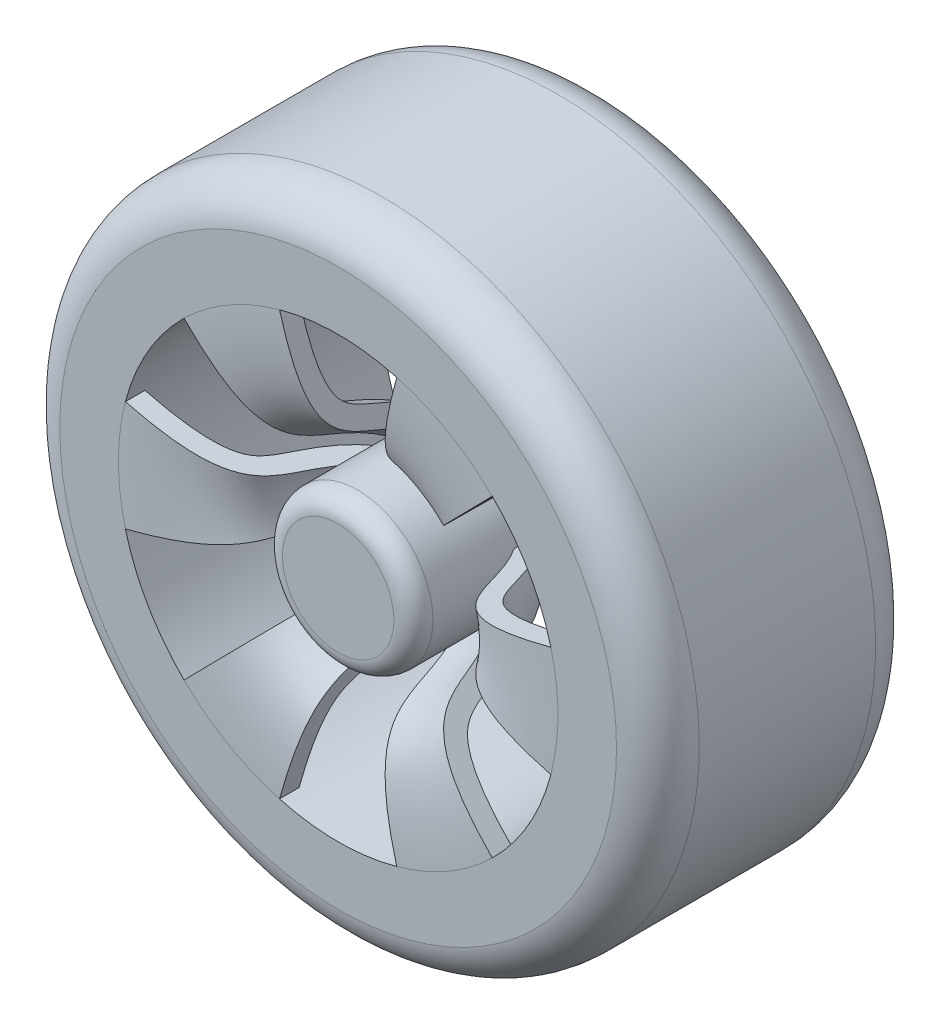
ISO-10303-21;
HEADER;
FILE_DESCRIPTION(('STEP AP214'),'2;1');
FILE_NAME('part.step','',(''),(''),'','','');
FILE_SCHEMA(('AUTOMOTIVE_DESIGN { 1 0 10303 214 1 1 1 1 }'));
ENDSEC;
DATA;
#1=APPLICATION_CONTEXT('core data for automotive mechanical design processes');
#2=APPLICATION_PROTOCOL_DEFINITION('international standard','automotive_design',2000,#1);
#3=PRODUCT_CONTEXT('',#1,'mechanical');
#4=PRODUCT('Part','Part','',(#3));
#5=PRODUCT_RELATED_PRODUCT_CATEGORY('part','',(#4));
#6=PRODUCT_DEFINITION_FORMATION('','',#4);
#7=PRODUCT_DEFINITION_CONTEXT('part definition',#1,'design');
#8=PRODUCT_DEFINITION('design','',#6,#7);
#9=PRODUCT_DEFINITION_SHAPE('','',#8);
#10=(LENGTH_UNIT() NAMED_UNIT(*) SI_UNIT(.MILLI.,.METRE.));
#11=(NAMED_UNIT(*) PLANE_ANGLE_UNIT() SI_UNIT($,.RADIAN.));
#12=(NAMED_UNIT(*) SI_UNIT($,.STERADIAN.) SOLID_ANGLE_UNIT());
#13=UNCERTAINTY_MEASURE_WITH_UNIT(LENGTH_MEASURE(1.E-05),#10,'distance_accuracy_value','');
#14=(GEOMETRIC_REPRESENTATION_CONTEXT(3) GLOBAL_UNCERTAINTY_ASSIGNED_CONTEXT((#13)) GLOBAL_UNIT_ASSIGNED_CONTEXT((#10,
#11,#12)) REPRESENTATION_CONTEXT('',''));
#15=CARTESIAN_POINT('',(0.,0.,0.));
#16=DIRECTION('',(0.,0.,1.));
#17=DIRECTION('',(1.,0.,0.));
#18=AXIS2_PLACEMENT_3D('',#15,#16,#17);
#19=CARTESIAN_POINT('',(20.1085485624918,28.7341005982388,35.5560049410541));
#20=DIRECTION('',(0.,0.,-1.));
#21=DIRECTION('',(-1.,0.,0.));
#22=AXIS2_PLACEMENT_3D('',#19,#20,#21);
#23=PLANE('',#22);
#24=DIRECTION('',(-1.,0.,0.));
#25=VECTOR('',#24,1.);
#26=CARTESIAN_POINT('',(20.1085485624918,27.4841005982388,35.5560049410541));
#27=LINE('',#26,#25);
#28=CARTESIAN_POINT('',(22.1085485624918,27.4841005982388,35.5560049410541));
#29=VERTEX_POINT('',#28);
#30=CARTESIAN_POINT('',(18.1085485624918,27.4841005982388,35.5560049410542));
#31=VERTEX_POINT('',#30);
#32=EDGE_CURVE('P0_E24',#29,#31,#27,.T.);
#33=ORIENTED_EDGE('',*,*,#32,.T.);
#34=CARTESIAN_POINT('',(18.7390245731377,28.7341005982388,35.5560049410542));
#35=DIRECTION('',(0.,0.,-1.));
#36=DIRECTION('',(-1.,0.,0.));
#37=AXIS2_PLACEMENT_3D('',#34,#35,#36);
#38=CIRCLE('',#37,1.4);
#39=CARTESIAN_POINT('',(18.1085485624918,29.9841005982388,35.5560049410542));
#40=VERTEX_POINT('',#39);
#41=EDGE_CURVE('P0_E11',#31,#40,#38,.T.);
#42=ORIENTED_EDGE('',*,*,#41,.T.);
#43=DIRECTION('',(1.,0.,0.));
#44=VECTOR('',#43,1.);
#45=CARTESIAN_POINT('',(20.1085485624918,29.9841005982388,35.5560049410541));
#46=LINE('',#45,#44);
#47=CARTESIAN_POINT('',(22.1085485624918,29.9841005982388,35.5560049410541));
#48=VERTEX_POINT('',#47);
#49=EDGE_CURVE('P0_E233',#40,#48,#46,.T.);
#50=ORIENTED_EDGE('',*,*,#49,.T.);
#51=CARTESIAN_POINT('',(21.4780725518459,28.7341005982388,35.5560049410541));
#52=DIRECTION('',(0.,0.,-1.));
#53=DIRECTION('',(-1.,0.,0.));
#54=AXIS2_PLACEMENT_3D('',#51,#52,#53);
#55=CIRCLE('',#54,1.4);
#56=EDGE_CURVE('P0_E207',#48,#29,#55,.T.);
#57=ORIENTED_EDGE('',*,*,#56,.T.);
#58=EDGE_LOOP('',(#33,#42,#50,#57));
#59=FACE_BOUND('',#58,.T.);
#60=CARTESIAN_POINT('',(20.1085485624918,28.7341005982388,35.5560049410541));
#61=DIRECTION('',(0.,0.,-1.));
#62=DIRECTION('',(-1.,0.,0.));
#63=AXIS2_PLACEMENT_3D('',#60,#61,#62);
#64=CIRCLE('',#63,4.5);
#65=CARTESIAN_POINT('',(15.6085485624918,28.7341005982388,35.5560049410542));
#66=VERTEX_POINT('',#65);
#67=EDGE_CURVE('P0_E230',#66,#66,#64,.F.);
#68=ORIENTED_EDGE('',*,*,#67,.T.);
#69=EDGE_LOOP('',(#68));
#70=FACE_BOUND('',#69,.T.);
#71=ADVANCED_FACE('P0_F16',(#59,#70),#23,.F.);
#72=CARTESIAN_POINT('',(20.108548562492,28.7341005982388,56.5560049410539));
#73=DIRECTION('',(0.,0.,1.));
#74=DIRECTION('',(1.,0.,0.));
#75=AXIS2_PLACEMENT_3D('',#72,#73,#74);
#76=PLANE('',#75);
#77=CARTESIAN_POINT('',(20.108548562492,28.7341005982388,56.5560049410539));
#78=DIRECTION('',(0.,0.,1.));
#79=DIRECTION('',(1.,0.,0.));
#80=AXIS2_PLACEMENT_3D('',#77,#78,#79);
#81=CIRCLE('',#80,4.5);
#82=CARTESIAN_POINT('',(24.608548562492,28.7341005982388,56.5560049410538));
#83=VERTEX_POINT('',#82);
#84=EDGE_CURVE('P0_E494',#83,#83,#81,.F.);
#85=ORIENTED_EDGE('',*,*,#84,.T.);
#86=EDGE_LOOP('',(#85));
#87=FACE_BOUND('',#86,.T.);
#88=ADVANCED_FACE('P0_F576',(#87),#76,.F.);
#89=CARTESIAN_POINT('',(20.1085485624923,28.7341005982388,80.3473351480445));
#90=DIRECTION('',(0.,0.,-1.));
#91=DIRECTION('',(-1.,0.,0.));
#92=AXIS2_PLACEMENT_3D('',#89,#90,#91);
#93=CYLINDRICAL_SURFACE('',#92,4.5);
#94=ORIENTED_EDGE('',*,*,#84,.F.);
#95=EDGE_LOOP('',(#94));
#96=FACE_BOUND('',#95,.T.);
#97=ORIENTED_EDGE('',*,*,#67,.F.);
#98=EDGE_LOOP('',(#97));
#99=FACE_BOUND('',#98,.T.);
#100=ADVANCED_FACE('P0_F582',(#96,#99),#93,.F.);
#101=CARTESIAN_POINT('',(18.7390245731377,28.7341005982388,36.5560049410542));
#102=DIRECTION('',(0.,0.,-1.));
#103=DIRECTION('',(-1.,0.,0.));
#104=AXIS2_PLACEMENT_3D('',#101,#102,#103);
#105=CYLINDRICAL_SURFACE('',#104,1.4);
#106=DIRECTION('',(0.,0.,-1.));
#107=VECTOR('',#106,1.);
#108=CARTESIAN_POINT('',(18.1085485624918,27.4841005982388,36.5560049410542));
#109=LINE('',#108,#107);
#110=CARTESIAN_POINT('',(18.1085485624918,27.4841005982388,31.5560049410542));
#111=VERTEX_POINT('',#110);
#112=EDGE_CURVE('P0_E225',#31,#111,#109,.T.);
#113=ORIENTED_EDGE('',*,*,#112,.T.);
#114=CARTESIAN_POINT('',(18.7390245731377,28.7341005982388,31.5560049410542));
#115=DIRECTION('',(0.,0.,-1.));
#116=DIRECTION('',(1.,0.,0.));
#117=AXIS2_PLACEMENT_3D('',#114,#115,#116);
#118=CIRCLE('',#117,1.4);
#119=CARTESIAN_POINT('',(18.1085485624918,29.9841005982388,31.5560049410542));
#120=VERTEX_POINT('',#119);
#121=EDGE_CURVE('P0_E31',#111,#120,#118,.T.);
#122=ORIENTED_EDGE('',*,*,#121,.T.);
#123=DIRECTION('',(0.,0.,-1.));
#124=VECTOR('',#123,1.);
#125=CARTESIAN_POINT('',(18.1085485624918,29.9841005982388,36.5560049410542));
#126=LINE('',#125,#124);
#127=EDGE_CURVE('P0_E210',#40,#120,#126,.T.);
#128=ORIENTED_EDGE('',*,*,#127,.F.);
#129=ORIENTED_EDGE('',*,*,#41,.F.);
#130=EDGE_LOOP('',(#113,#122,#128,#129));
#131=FACE_BOUND('',#130,.T.);
#132=ADVANCED_FACE('P0_F589',(#131),#105,.F.);
#133=CARTESIAN_POINT('',(22.1085485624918,27.4841005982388,36.5560049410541));
#134=DIRECTION('',(0.,-1.,0.));
#135=DIRECTION('',(1.,0.,0.));
#136=AXIS2_PLACEMENT_3D('',#133,#134,#135);
#137=PLANE('',#136);
#138=DIRECTION('',(0.,0.,-1.));
#139=VECTOR('',#138,1.);
#140=CARTESIAN_POINT('',(22.1085485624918,27.4841005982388,36.5560049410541));
#141=LINE('',#140,#139);
#142=CARTESIAN_POINT('',(22.1085485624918,27.4841005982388,31.5560049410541));
#143=VERTEX_POINT('',#142);
#144=EDGE_CURVE('P0_E209',#29,#143,#141,.T.);
#145=ORIENTED_EDGE('',*,*,#144,.T.);
#146=DIRECTION('',(-1.,0.,0.));
#147=VECTOR('',#146,1.);
#148=CARTESIAN_POINT('',(22.1085485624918,27.4841005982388,31.5560049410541));
#149=LINE('',#148,#147);
#150=EDGE_CURVE('P0_E220',#143,#111,#149,.T.);
#151=ORIENTED_EDGE('',*,*,#150,.T.);
#152=ORIENTED_EDGE('',*,*,#112,.F.);
#153=ORIENTED_EDGE('',*,*,#32,.F.);
#154=EDGE_LOOP('',(#145,#151,#152,#153));
#155=FACE_BOUND('',#154,.T.);
#156=ADVANCED_FACE('P0_F707',(#155),#137,.F.);
#157=CARTESIAN_POINT('',(21.4780725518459,28.7341005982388,36.5560049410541));
#158=DIRECTION('',(0.,0.,-1.));
#159=DIRECTION('',(-1.,0.,0.));
#160=AXIS2_PLACEMENT_3D('',#157,#158,#159);
#161=CYLINDRICAL_SURFACE('',#160,1.4);
#162=DIRECTION('',(0.,0.,-1.));
#163=VECTOR('',#162,1.);
#164=CARTESIAN_POINT('',(22.1085485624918,29.9841005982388,36.5560049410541));
#165=LINE('',#164,#163);
#166=CARTESIAN_POINT('',(22.1085485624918,29.9841005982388,31.5560049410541));
#167=VERTEX_POINT('',#166);
#168=EDGE_CURVE('P0_E39',#48,#167,#165,.T.);
#169=ORIENTED_EDGE('',*,*,#168,.T.);
#170=CARTESIAN_POINT('',(21.4780725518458,28.7341005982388,31.5560049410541));
#171=DIRECTION('',(0.,0.,-1.));
#172=DIRECTION('',(-1.,0.,0.));
#173=AXIS2_PLACEMENT_3D('',#170,#171,#172);
#174=CIRCLE('',#173,1.4);
#175=EDGE_CURVE('P0_E204',#167,#143,#174,.T.);
#176=ORIENTED_EDGE('',*,*,#175,.T.);
#177=ORIENTED_EDGE('',*,*,#144,.F.);
#178=ORIENTED_EDGE('',*,*,#56,.F.);
#179=EDGE_LOOP('',(#169,#176,#177,#178));
#180=FACE_BOUND('',#179,.T.);
#181=ADVANCED_FACE('P0_F201',(#180),#161,.F.);
#182=CARTESIAN_POINT('',(22.1085485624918,29.9841005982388,36.5560049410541));
#183=DIRECTION('',(0.,1.,0.));
#184=DIRECTION('',(-1.,0.,0.));
#185=AXIS2_PLACEMENT_3D('',#182,#183,#184);
#186=PLANE('',#185);
#187=ORIENTED_EDGE('',*,*,#127,.T.);
#188=DIRECTION('',(1.,0.,0.));
#189=VECTOR('',#188,1.);
#190=CARTESIAN_POINT('',(22.1085485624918,29.9841005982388,31.5560049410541));
#191=LINE('',#190,#189);
#192=EDGE_CURVE('P0_E213',#120,#167,#191,.T.);
#193=ORIENTED_EDGE('',*,*,#192,.T.);
#194=ORIENTED_EDGE('',*,*,#168,.F.);
#195=ORIENTED_EDGE('',*,*,#49,.F.);
#196=EDGE_LOOP('',(#187,#193,#194,#195));
#197=FACE_BOUND('',#196,.T.);
#198=ADVANCED_FACE('P0_F214',(#197),#186,.F.);
#199=CARTESIAN_POINT('',(20.1085485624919,33.2341005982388,45.056004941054));
#200=CARTESIAN_POINT('',(20.108548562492,42.4729334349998,51.3585526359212));
#201=CARTESIAN_POINT('',(20.108548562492,34.4399547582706,58.5560049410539));
#202=CARTESIAN_POINT('',(20.108548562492,51.234100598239,58.5560049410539));
#203=B_SPLINE_CURVE_WITH_KNOTS('',3,(#199,#200,#201,#202),.UNSPECIFIED.,.F.,.F.,(4,4),(0.,1.),.UNSPECIFIED.);
#204=CARTESIAN_POINT('',(20.1085485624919,28.7341005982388,45.056004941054));
#205=DIRECTION('',(0.,0.,-1.));
#206=AXIS1_PLACEMENT('',#204,#205);
#207=SURFACE_OF_REVOLUTION('',#203,#206);
#208=CARTESIAN_POINT('',(20.1085485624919,28.7341005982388,48.0164091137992));
#209=DIRECTION('',(0.,0.,-1.));
#210=DIRECTION('',(-1.,0.,0.));
#211=AXIS2_PLACEMENT_3D('',#208,#209,#210);
#212=CIRCLE('',#211,7.70439868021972);
#213=CARTESIAN_POINT('',(25.5118919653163,23.2421392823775,48.0164091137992));
#214=VERTEX_POINT('',#213);
#215=CARTESIAN_POINT('',(22.163054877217,21.3086872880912,48.0164091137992));
#216=VERTEX_POINT('',#215);
#217=EDGE_CURVE('P0_E730',#214,#216,#212,.T.);
#218=ORIENTED_EDGE('',*,*,#217,.T.);
#219=CARTESIAN_POINT('',(21.3085485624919,24.3970509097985,45.056004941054));
#220=CARTESIAN_POINT('',(23.7722373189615,15.4927671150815,51.3585526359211));
#221=CARTESIAN_POINT('',(21.6301096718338,23.2348621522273,58.5560049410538));
#222=CARTESIAN_POINT('',(26.108548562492,7.04885215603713,58.5560049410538));
#223=B_SPLINE_CURVE_WITH_KNOTS('',3,(#219,#220,#221,#222),.UNSPECIFIED.,.F.,.F.,(4,4),(0.,1.),.UNSPECIFIED.);
#224=CARTESIAN_POINT('',(26.108548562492,7.04885215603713,58.5560049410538));
#225=VERTEX_POINT('',#224);
#226=EDGE_CURVE('P0_E443',#216,#225,#223,.T.);
#227=ORIENTED_EDGE('',*,*,#226,.T.);
#228=CARTESIAN_POINT('',(20.108548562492,28.7341005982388,58.5560049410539));
#229=DIRECTION('',(0.,0.,-1.));
#230=DIRECTION('',(-1.,0.,0.));
#231=AXIS2_PLACEMENT_3D('',#228,#229,#230);
#232=CIRCLE('',#231,22.5000000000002);
#233=CARTESIAN_POINT('',(35.8885246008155,12.6953239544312,58.5560049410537));
#234=VERTEX_POINT('',#233);
#235=EDGE_CURVE('P0_E790',#234,#225,#232,.T.);
#236=ORIENTED_EDGE('',*,*,#235,.F.);
#237=CARTESIAN_POINT('',(23.2645437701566,25.5263452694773,45.056004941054));
#238=CARTESIAN_POINT('',(29.7440353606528,18.940586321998,51.3585526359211));
#239=CARTESIAN_POINT('',(24.1102482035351,24.6667708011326,58.5560049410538));
#240=CARTESIAN_POINT('',(35.8885246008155,12.6953239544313,58.5560049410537));
#241=B_SPLINE_CURVE_WITH_KNOTS('',3,(#237,#238,#239,#240),.UNSPECIFIED.,.F.,.F.,(4,4),(0.,1.),.UNSPECIFIED.);
#242=EDGE_CURVE('P0_E395',#234,#214,#241,.F.);
#243=ORIENTED_EDGE('',*,*,#242,.T.);
#244=EDGE_LOOP('',(#218,#227,#236,#243));
#245=FACE_BOUND('',#244,.T.);
#246=ADVANCED_FACE('P0_F536',(#245),#207,.T.);
#247=CARTESIAN_POINT('',(27.5663982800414,30.6675525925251,48.0164091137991));
#248=VERTEX_POINT('',#247);
#249=CARTESIAN_POINT('',(27.5663982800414,26.8006486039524,48.0164091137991));
#250=VERTEX_POINT('',#249);
#251=EDGE_CURVE('P0_E509',#248,#250,#212,.T.);
#252=ORIENTED_EDGE('',*,*,#251,.T.);
#253=CARTESIAN_POINT('',(24.4645437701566,27.6048062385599,45.056004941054));
#254=CARTESIAN_POINT('',(33.4077241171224,25.2862813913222,51.358552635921));
#255=CARTESIAN_POINT('',(25.6318093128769,27.3021919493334,58.5560049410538));
#256=CARTESIAN_POINT('',(41.8885246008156,23.0876287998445,58.5560049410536));
#257=B_SPLINE_CURVE_WITH_KNOTS('',3,(#253,#254,#255,#256),.UNSPECIFIED.,.F.,.F.,(4,4),(0.,1.),.UNSPECIFIED.);
#258=CARTESIAN_POINT('',(41.8885246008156,23.0876287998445,58.5560049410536));
#259=VERTEX_POINT('',#258);
#260=EDGE_CURVE('P0_E411',#250,#259,#257,.T.);
#261=ORIENTED_EDGE('',*,*,#260,.T.);
#262=CARTESIAN_POINT('',(41.8885246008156,34.3805723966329,58.5560049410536));
#263=VERTEX_POINT('',#262);
#264=EDGE_CURVE('P0_E787',#263,#259,#232,.T.);
#265=ORIENTED_EDGE('',*,*,#264,.F.);
#266=CARTESIAN_POINT('',(24.4645437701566,29.8633949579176,45.056004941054));
#267=CARTESIAN_POINT('',(33.4077241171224,32.1819198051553,51.358552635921));
#268=CARTESIAN_POINT('',(25.6318093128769,30.1660092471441,58.5560049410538));
#269=CARTESIAN_POINT('',(41.8885246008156,34.3805723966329,58.5560049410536));
#270=B_SPLINE_CURVE_WITH_KNOTS('',3,(#266,#267,#268,#269),.UNSPECIFIED.,.F.,.F.,(4,4),(0.,1.),.UNSPECIFIED.);
#271=EDGE_CURVE('P0_E299',#263,#248,#270,.F.);
#272=ORIENTED_EDGE('',*,*,#271,.T.);
#273=EDGE_LOOP('',(#252,#261,#265,#272));
#274=FACE_BOUND('',#273,.T.);
#275=ADVANCED_FACE('P0_F721',(#274),#207,.T.);
#276=CARTESIAN_POINT('',(14.108548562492,7.04885215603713,58.5560049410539));
#277=VERTEX_POINT('',#276);
#278=CARTESIAN_POINT('',(4.32857252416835,12.6953239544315,58.556004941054));
#279=VERTEX_POINT('',#278);
#280=EDGE_CURVE('P0_E791',#277,#279,#232,.T.);
#281=ORIENTED_EDGE('',*,*,#280,.F.);
#282=CARTESIAN_POINT('',(18.9085485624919,24.3970509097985,45.056004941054));
#283=CARTESIAN_POINT('',(16.4448598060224,15.4927671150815,51.3585526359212));
#284=CARTESIAN_POINT('',(18.5869874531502,23.2348621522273,58.5560049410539));
#285=CARTESIAN_POINT('',(14.1085485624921,7.04885215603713,58.5560049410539));
#286=B_SPLINE_CURVE_WITH_KNOTS('',3,(#282,#283,#284,#285),.UNSPECIFIED.,.F.,.F.,(4,4),(0.,1.),.UNSPECIFIED.);
#287=CARTESIAN_POINT('',(18.0540422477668,21.3086872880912,48.0164091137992));
#288=VERTEX_POINT('',#287);
#289=EDGE_CURVE('P0_E427',#277,#288,#286,.F.);
#290=ORIENTED_EDGE('',*,*,#289,.T.);
#291=CARTESIAN_POINT('',(14.7052051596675,23.2421392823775,48.0164091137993));
#292=VERTEX_POINT('',#291);
#293=EDGE_CURVE('P0_E736',#288,#292,#212,.T.);
#294=ORIENTED_EDGE('',*,*,#293,.T.);
#295=CARTESIAN_POINT('',(16.9525533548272,25.5263452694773,45.056004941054));
#296=CARTESIAN_POINT('',(10.473061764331,18.9405863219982,51.3585526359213));
#297=CARTESIAN_POINT('',(16.1068489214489,24.6667708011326,58.5560049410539));
#298=CARTESIAN_POINT('',(4.32857252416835,12.6953239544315,58.556004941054));
#299=B_SPLINE_CURVE_WITH_KNOTS('',3,(#295,#296,#297,#298),.UNSPECIFIED.,.F.,.F.,(4,4),(0.,1.),.UNSPECIFIED.);
#300=EDGE_CURVE('P0_E379',#292,#279,#299,.T.);
#301=ORIENTED_EDGE('',*,*,#300,.T.);
#302=EDGE_LOOP('',(#281,#290,#294,#301));
#303=FACE_BOUND('',#302,.T.);
#304=ADVANCED_FACE('P0_F726',(#303),#207,.T.);
#305=CARTESIAN_POINT('',(-1.67142747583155,23.0876287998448,58.5560049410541));
#306=VERTEX_POINT('',#305);
#307=CARTESIAN_POINT('',(-1.67142747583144,34.3805723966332,58.5560049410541));
#308=VERTEX_POINT('',#307);
#309=EDGE_CURVE('P0_E794',#306,#308,#232,.T.);
#310=ORIENTED_EDGE('',*,*,#309,.F.);
#311=CARTESIAN_POINT('',(15.7525533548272,27.60480623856,45.056004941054));
#312=CARTESIAN_POINT('',(6.80937300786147,25.2862813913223,51.3585526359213));
#313=CARTESIAN_POINT('',(14.5852878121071,27.3021919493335,58.5560049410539));
#314=CARTESIAN_POINT('',(-1.67142747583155,23.0876287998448,58.5560049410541));
#315=B_SPLINE_CURVE_WITH_KNOTS('',3,(#311,#312,#313,#314),.UNSPECIFIED.,.F.,.F.,(4,4),(0.,1.),.UNSPECIFIED.);
#316=CARTESIAN_POINT('',(12.6506988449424,26.8006486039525,48.0164091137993));
#317=VERTEX_POINT('',#316);
#318=EDGE_CURVE('P0_E363',#306,#317,#315,.F.);
#319=ORIENTED_EDGE('',*,*,#318,.T.);
#320=CARTESIAN_POINT('',(12.6506988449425,30.6675525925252,48.0164091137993));
#321=VERTEX_POINT('',#320);
#322=EDGE_CURVE('P0_E739',#317,#321,#212,.T.);
#323=ORIENTED_EDGE('',*,*,#322,.T.);
#324=CARTESIAN_POINT('',(15.7525533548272,29.8633949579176,45.056004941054));
#325=CARTESIAN_POINT('',(6.80937300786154,32.1819198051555,51.3585526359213));
#326=CARTESIAN_POINT('',(14.5852878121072,30.1660092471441,58.5560049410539));
#327=CARTESIAN_POINT('',(-1.67142747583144,34.3805723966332,58.5560049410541));
#328=B_SPLINE_CURVE_WITH_KNOTS('',3,(#324,#325,#326,#327),.UNSPECIFIED.,.F.,.F.,(4,4),(0.,1.),.UNSPECIFIED.);
#329=EDGE_CURVE('P0_E347',#321,#308,#328,.T.);
#330=ORIENTED_EDGE('',*,*,#329,.T.);
#331=EDGE_LOOP('',(#310,#319,#323,#330));
#332=FACE_BOUND('',#331,.T.);
#333=ADVANCED_FACE('P0_F804',(#332),#207,.T.);
#334=CARTESIAN_POINT('',(22.163054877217,36.1595139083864,48.0164091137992));
#335=VERTEX_POINT('',#334);
#336=CARTESIAN_POINT('',(25.5118919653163,34.2260619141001,48.0164091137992));
#337=VERTEX_POINT('',#336);
#338=EDGE_CURVE('P0_E505',#335,#337,#212,.T.);
#339=ORIENTED_EDGE('',*,*,#338,.T.);
#340=CARTESIAN_POINT('',(23.2645437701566,31.9418559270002,45.056004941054));
#341=CARTESIAN_POINT('',(29.7440353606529,38.5276148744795,51.3585526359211));
#342=CARTESIAN_POINT('',(24.1102482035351,32.8014303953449,58.5560049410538));
#343=CARTESIAN_POINT('',(35.8885246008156,44.7728772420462,58.5560049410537));
#344=B_SPLINE_CURVE_WITH_KNOTS('',3,(#340,#341,#342,#343),.UNSPECIFIED.,.F.,.F.,(4,4),(0.,1.),.UNSPECIFIED.);
#345=CARTESIAN_POINT('',(35.8885246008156,44.7728772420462,58.5560049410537));
#346=VERTEX_POINT('',#345);
#347=EDGE_CURVE('P0_E315',#337,#346,#344,.T.);
#348=ORIENTED_EDGE('',*,*,#347,.T.);
#349=CARTESIAN_POINT('',(26.108548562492,50.4193490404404,58.5560049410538));
#350=VERTEX_POINT('',#349);
#351=EDGE_CURVE('P0_E680',#350,#346,#232,.T.);
#352=ORIENTED_EDGE('',*,*,#351,.F.);
#353=CARTESIAN_POINT('',(21.3085485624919,33.0711502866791,45.056004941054));
#354=CARTESIAN_POINT('',(23.7722373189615,41.975434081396,51.3585526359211));
#355=CARTESIAN_POINT('',(21.6301096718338,34.2333390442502,58.5560049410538));
#356=CARTESIAN_POINT('',(26.108548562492,50.4193490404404,58.5560049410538));
#357=B_SPLINE_CURVE_WITH_KNOTS('',3,(#353,#354,#355,#356),.UNSPECIFIED.,.F.,.F.,(4,4),(0.,1.),.UNSPECIFIED.);
#358=EDGE_CURVE('P0_E469',#350,#335,#357,.F.);
#359=ORIENTED_EDGE('',*,*,#358,.T.);
#360=EDGE_LOOP('',(#339,#348,#352,#359));
#361=FACE_BOUND('',#360,.T.);
#362=ADVANCED_FACE('P0_F537',(#361),#207,.T.);
#363=CARTESIAN_POINT('',(20.108548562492,51.2341005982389,56.5560049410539));
#364=CARTESIAN_POINT('',(20.108548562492,50.9869662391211,56.5560026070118));
#365=CARTESIAN_POINT('',(20.108548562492,50.4835820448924,56.5526024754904));
#366=CARTESIAN_POINT('',(20.108548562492,49.5498752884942,56.5325878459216));
#367=CARTESIAN_POINT('',(20.108548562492,48.4668542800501,56.4835108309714));
#368=CARTESIAN_POINT('',(20.108548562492,47.3116656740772,56.3886945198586));
#369=CARTESIAN_POINT('',(20.108548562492,45.9502596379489,56.2184993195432));
#370=CARTESIAN_POINT('',(20.108548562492,44.5715414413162,55.932354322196));
#371=CARTESIAN_POINT('',(20.108548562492,43.3792101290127,55.5089225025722));
#372=CARTESIAN_POINT('',(20.108548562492,42.5694679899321,55.0497868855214));
#373=CARTESIAN_POINT('',(20.108548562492,42.0162976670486,54.5720445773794));
#374=CARTESIAN_POINT('',(20.108548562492,41.5852299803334,54.0245830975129));
#375=CARTESIAN_POINT('',(20.108548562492,41.0710519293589,53.1011930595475));
#376=CARTESIAN_POINT('',(20.108548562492,40.4770899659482,51.4907279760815));
#377=CARTESIAN_POINT('',(20.1085485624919,39.6589272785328,49.3772114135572));
#378=CARTESIAN_POINT('',(20.1085485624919,38.5942246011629,47.535902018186));
#379=CARTESIAN_POINT('',(20.1085485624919,37.5319369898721,46.1290858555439));
#380=CARTESIAN_POINT('',(20.1085485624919,36.3820347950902,44.9678154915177));
#381=CARTESIAN_POINT('',(20.1085485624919,35.2955934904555,44.0685761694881));
#382=CARTESIAN_POINT('',(20.1085485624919,34.6724962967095,43.6159623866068));
#383=CARTESIAN_POINT('',(20.1085485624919,34.3613211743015,43.40368061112));
#384=B_SPLINE_CURVE_WITH_KNOTS('',3,(#363,#364,#365,#366,#367,#368,#369,#370,#371,#372,#373,
#374,#375,#376,#377,#378,#379,#380,#381,#382,#383),.UNSPECIFIED.,.F.,.F.,(4,1,1,1,1,1,1,1,1,1,1,
1,1,1,1,1,1,1,4),(0.,0.015625,0.03125,0.0625,0.09375,0.125,0.1875,0.25,0.3125,0.375,0.4375,0.5,
0.625,0.75,0.8125,0.875,0.9375,0.96875,1.),.UNSPECIFIED.);
#385=CARTESIAN_POINT('',(20.1085485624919,28.7341005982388,45.056004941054));
#386=DIRECTION('',(0.,0.,-1.));
#387=AXIS1_PLACEMENT('',#385,#386);
#388=SURFACE_OF_REVOLUTION('',#384,#387);
#389=CARTESIAN_POINT('',(20.108548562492,28.7341005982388,56.5560049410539));
#390=DIRECTION('',(0.,0.,-1.));
#391=DIRECTION('',(-1.,0.,0.));
#392=AXIS2_PLACEMENT_3D('',#389,#390,#391);
#393=CIRCLE('',#392,22.5000000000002);
#394=CARTESIAN_POINT('',(35.8885246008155,12.6953239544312,56.5560049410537));
#395=VERTEX_POINT('',#394);
#396=CARTESIAN_POINT('',(26.108548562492,7.04885215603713,56.5560049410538));
#397=VERTEX_POINT('',#396);
#398=EDGE_CURVE('P0_E810',#395,#397,#393,.T.);
#399=ORIENTED_EDGE('',*,*,#398,.T.);
#400=CARTESIAN_POINT('',(26.108548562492,7.04885215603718,56.5560049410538));
#401=CARTESIAN_POINT('',(26.0426460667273,7.28703748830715,56.5560026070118));
#402=CARTESIAN_POINT('',(25.9084102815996,7.77219354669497,56.5526024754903));
#403=CARTESIAN_POINT('',(25.6594218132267,8.67208967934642,56.5325878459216));
#404=CARTESIAN_POINT('',(25.370616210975,9.71589321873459,56.4835108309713));
#405=CARTESIAN_POINT('',(25.0625659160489,10.8292510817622,56.3886945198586));
#406=CARTESIAN_POINT('',(24.6995243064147,12.1413589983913,56.2184993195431));
#407=CARTESIAN_POINT('',(24.331866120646,13.4701521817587,55.9323543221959));
#408=CARTESIAN_POINT('',(24.0139111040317,14.6193077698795,55.5089225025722));
#409=CARTESIAN_POINT('',(23.7979798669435,15.3997281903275,55.0497868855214));
#410=CARTESIAN_POINT('',(23.6504677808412,15.9328675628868,54.5720445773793));
#411=CARTESIAN_POINT('',(23.5355163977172,16.3483257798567,54.0245830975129));
#412=CARTESIAN_POINT('',(23.3984022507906,16.8438848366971,53.1011930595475));
#413=CARTESIAN_POINT('',(23.2400123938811,17.4163387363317,51.4907279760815));
#414=CARTESIAN_POINT('',(23.021835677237,18.2048747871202,49.3772114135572));
#415=CARTESIAN_POINT('',(22.7379149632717,19.2310233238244,47.535902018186));
#416=CARTESIAN_POINT('',(22.4546382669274,20.2548442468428,46.1290858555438));
#417=CARTESIAN_POINT('',(22.1479976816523,21.3631071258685,44.9678154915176));
#418=CARTESIAN_POINT('',(21.8582800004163,22.4102071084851,44.0685761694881));
#419=CARTESIAN_POINT('',(21.6921207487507,23.0107412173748,43.6159623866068));
#420=CARTESIAN_POINT('',(21.6091407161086,23.310648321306,43.40368061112));
#421=B_SPLINE_CURVE_WITH_KNOTS('',3,(#400,#401,#402,#403,#404,#405,#406,#407,#408,#409,#410,
#411,#412,#413,#414,#415,#416,#417,#418,#419,#420),.UNSPECIFIED.,.F.,.F.,(4,1,1,1,1,1,1,1,1,1,1,
1,1,1,1,1,1,1,4),(0.,0.015625,0.03125,0.0625,0.09375,0.125,0.1875,0.25,0.3125,0.375,0.4375,0.5,
0.625,0.75,0.8125,0.875,0.9375,0.96875,1.),.UNSPECIFIED.);
#422=CARTESIAN_POINT('',(22.163054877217,21.3086872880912,45.056004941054));
#423=VERTEX_POINT('',#422);
#424=EDGE_CURVE('P0_E435',#397,#423,#421,.T.);
#425=ORIENTED_EDGE('',*,*,#424,.T.);
#426=CARTESIAN_POINT('',(20.1085485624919,28.7341005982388,45.056004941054));
#427=DIRECTION('',(0.,0.,-1.));
#428=DIRECTION('',(-1.,0.,0.));
#429=AXIS2_PLACEMENT_3D('',#426,#427,#428);
#430=CIRCLE('',#429,7.70439868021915);
#431=CARTESIAN_POINT('',(25.5118919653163,23.2421392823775,45.056004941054));
#432=VERTEX_POINT('',#431);
#433=EDGE_CURVE('P0_E764',#432,#423,#430,.T.);
#434=ORIENTED_EDGE('',*,*,#433,.F.);
#435=CARTESIAN_POINT('',(35.8885246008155,12.6953239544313,56.5560049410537));
#436=CARTESIAN_POINT('',(35.7152013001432,12.8714898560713,56.5560026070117));
#437=CARTESIAN_POINT('',(35.3621617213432,13.2303194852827,56.5526024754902));
#438=CARTESIAN_POINT('',(34.7073230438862,13.8958978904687,56.5325878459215));
#439=CARTESIAN_POINT('',(33.9477654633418,14.6679126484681,56.4835108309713));
#440=CARTESIAN_POINT('',(33.1375944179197,15.4913709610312,56.3886945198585));
#441=CARTESIAN_POINT('',(32.1827964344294,16.4618281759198,56.2184993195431));
#442=CARTESIAN_POINT('',(31.215856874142,17.4446260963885,55.9323543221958));
#443=CARTESIAN_POINT('',(30.3796364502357,18.2945610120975,55.5089225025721));
#444=CARTESIAN_POINT('',(29.8117381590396,18.8717731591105,55.0497868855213));
#445=CARTESIAN_POINT('',(29.4237819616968,19.26609205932,54.5720445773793));
#446=CARTESIAN_POINT('',(29.1214602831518,19.5733719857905,54.0245830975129));
#447=CARTESIAN_POINT('',(28.7608506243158,19.9398958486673,53.1011930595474));
#448=CARTESIAN_POINT('',(28.3442859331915,20.36329243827,51.4907279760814));
#449=CARTESIAN_POINT('',(27.7704820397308,20.9465070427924,49.3772114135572));
#450=CARTESIAN_POINT('',(27.0237716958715,21.705463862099,47.5359020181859));
#451=CARTESIAN_POINT('',(26.2787551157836,22.4626991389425,46.1290858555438));
#452=CARTESIAN_POINT('',(25.4722916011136,23.2823891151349,44.9678154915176));
#453=CARTESIAN_POINT('',(24.7103352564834,24.056841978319,44.0685761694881));
#454=CARTESIAN_POINT('',(24.2733370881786,24.5010071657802,43.6159623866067));
#455=CARTESIAN_POINT('',(24.0550999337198,24.7228235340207,43.40368061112));
#456=B_SPLINE_CURVE_WITH_KNOTS('',3,(#435,#436,#437,#438,#439,#440,#441,#442,#443,#444,#445,
#446,#447,#448,#449,#450,#451,#452,#453,#454,#455),.UNSPECIFIED.,.F.,.F.,(4,1,1,1,1,1,1,1,1,1,1,
1,1,1,1,1,1,1,4),(0.,0.015625,0.03125,0.0625,0.09375,0.125,0.1875,0.25,0.3125,0.375,0.4375,0.5,
0.625,0.75,0.8125,0.875,0.9375,0.96875,1.),.UNSPECIFIED.);
#457=EDGE_CURVE('P0_E387',#432,#395,#456,.F.);
#458=ORIENTED_EDGE('',*,*,#457,.T.);
#459=EDGE_LOOP('',(#399,#425,#434,#458));
#460=FACE_BOUND('',#459,.T.);
#461=ADVANCED_FACE('P0_F529',(#460),#388,.T.);
#462=CARTESIAN_POINT('',(41.8885246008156,34.3805723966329,56.5560049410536));
#463=VERTEX_POINT('',#462);
#464=CARTESIAN_POINT('',(41.8885246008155,23.0876287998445,56.5560049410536));
#465=VERTEX_POINT('',#464);
#466=EDGE_CURVE('P0_E670',#463,#465,#393,.T.);
#467=ORIENTED_EDGE('',*,*,#466,.T.);
#468=CARTESIAN_POINT('',(41.8885246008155,23.0876287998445,56.5560049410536));
#469=CARTESIAN_POINT('',(41.6492988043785,23.1496482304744,56.5560026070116));
#470=CARTESIAN_POINT('',(41.1620234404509,23.2759746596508,56.5526024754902));
#471=CARTESIAN_POINT('',(40.2581962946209,23.5102923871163,56.5325878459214));
#472=CARTESIAN_POINT('',(39.2098331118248,23.7820811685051,56.4835108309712));
#473=CARTESIAN_POINT('',(38.0916117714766,24.0719807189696,56.3886945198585));
#474=CARTESIAN_POINT('',(36.7737721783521,24.4136314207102,56.218499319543));
#475=CARTESIAN_POINT('',(35.439174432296,24.7596266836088,55.9323543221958));
#476=CARTESIAN_POINT('',(34.2849989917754,25.0588473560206,55.5089225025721));
#477=CARTESIAN_POINT('',(33.5011694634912,25.2620556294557,55.0497868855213));
#478=CARTESIAN_POINT('',(32.965701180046,25.4008761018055,54.5720445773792));
#479=CARTESIAN_POINT('',(32.548428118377,25.5090543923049,54.0245830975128));
#480=CARTESIAN_POINT('',(32.0507043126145,25.6380895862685,53.1011930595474));
#481=CARTESIAN_POINT('',(31.4757497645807,25.7871468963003,51.4907279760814));
#482=CARTESIAN_POINT('',(30.6837691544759,25.9924683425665,49.3772114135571));
#483=CARTESIAN_POINT('',(29.6531380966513,26.259660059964,47.5359020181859));
#484=CARTESIAN_POINT('',(28.6248448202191,26.526245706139,46.1290858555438));
#485=CARTESIAN_POINT('',(27.511740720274,26.8148186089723,44.9678154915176));
#486=CARTESIAN_POINT('',(26.4600666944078,27.0874657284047,44.068576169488));
#487=CARTESIAN_POINT('',(25.8569092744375,27.2438346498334,43.6159623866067));
#488=CARTESIAN_POINT('',(25.5556920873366,27.321925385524,43.40368061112));
#489=B_SPLINE_CURVE_WITH_KNOTS('',3,(#468,#469,#470,#471,#472,#473,#474,#475,#476,#477,#478,
#479,#480,#481,#482,#483,#484,#485,#486,#487,#488),.UNSPECIFIED.,.F.,.F.,(4,1,1,1,1,1,1,1,1,1,1,
1,1,1,1,1,1,1,4),(0.,0.015625,0.03125,0.0625,0.09375,0.125,0.1875,0.25,0.3125,0.375,0.4375,0.5,
0.625,0.75,0.8125,0.875,0.9375,0.96875,1.),.UNSPECIFIED.);
#490=CARTESIAN_POINT('',(27.5663982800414,26.8006486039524,45.0560049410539));
#491=VERTEX_POINT('',#490);
#492=EDGE_CURVE('P0_E403',#465,#491,#489,.T.);
#493=ORIENTED_EDGE('',*,*,#492,.T.);
#494=CARTESIAN_POINT('',(27.5663982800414,30.6675525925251,45.0560049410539));
#495=VERTEX_POINT('',#494);
#496=EDGE_CURVE('P0_E675',#495,#491,#430,.T.);
#497=ORIENTED_EDGE('',*,*,#496,.F.);
#498=CARTESIAN_POINT('',(41.8885246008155,34.3805723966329,56.5560049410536));
#499=CARTESIAN_POINT('',(41.6492988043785,34.318552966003,56.5560026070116));
#500=CARTESIAN_POINT('',(41.1620234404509,34.1922265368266,56.5526024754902));
#501=CARTESIAN_POINT('',(40.258196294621,33.9579088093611,56.5325878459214));
#502=CARTESIAN_POINT('',(39.2098331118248,33.6861200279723,56.4835108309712));
#503=CARTESIAN_POINT('',(38.0916117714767,33.3962204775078,56.3886945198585));
#504=CARTESIAN_POINT('',(36.7737721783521,33.0545697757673,56.218499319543));
#505=CARTESIAN_POINT('',(35.439174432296,32.7085745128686,55.9323543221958));
#506=CARTESIAN_POINT('',(34.2849989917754,32.4093538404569,55.5089225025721));
#507=CARTESIAN_POINT('',(33.5011694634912,32.2061455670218,55.0497868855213));
#508=CARTESIAN_POINT('',(32.965701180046,32.067325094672,54.5720445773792));
#509=CARTESIAN_POINT('',(32.5484281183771,31.9591468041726,54.0245830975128));
#510=CARTESIAN_POINT('',(32.0507043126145,31.830111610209,53.1011930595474));
#511=CARTESIAN_POINT('',(31.4757497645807,31.6810543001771,51.4907279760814));
#512=CARTESIAN_POINT('',(30.6837691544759,31.4757328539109,49.3772114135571));
#513=CARTESIAN_POINT('',(29.6531380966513,31.2085411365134,47.5359020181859));
#514=CARTESIAN_POINT('',(28.6248448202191,30.9419554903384,46.1290858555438));
#515=CARTESIAN_POINT('',(27.511740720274,30.6533825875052,44.9678154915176));
#516=CARTESIAN_POINT('',(26.4600666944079,30.3807354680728,44.068576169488));
#517=CARTESIAN_POINT('',(25.8569092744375,30.2243665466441,43.6159623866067));
#518=CARTESIAN_POINT('',(25.5556920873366,30.1462758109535,43.40368061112));
#519=B_SPLINE_CURVE_WITH_KNOTS('',3,(#498,#499,#500,#501,#502,#503,#504,#505,#506,#507,#508,
#509,#510,#511,#512,#513,#514,#515,#516,#517,#518),.UNSPECIFIED.,.F.,.F.,(4,1,1,1,1,1,1,1,1,1,1,
1,1,1,1,1,1,1,4),(0.,0.015625,0.03125,0.0625,0.09375,0.125,0.1875,0.25,0.3125,0.375,0.4375,0.5,
0.625,0.75,0.8125,0.875,0.9375,0.96875,1.),.UNSPECIFIED.);
#520=EDGE_CURVE('P0_E289',#495,#463,#519,.F.);
#521=ORIENTED_EDGE('',*,*,#520,.T.);
#522=EDGE_LOOP('',(#467,#493,#497,#521));
#523=FACE_BOUND('',#522,.T.);
#524=ADVANCED_FACE('P0_F777',(#523),#388,.T.);
#525=CARTESIAN_POINT('',(18.0540422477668,21.3086872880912,45.056004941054));
#526=VERTEX_POINT('',#525);
#527=CARTESIAN_POINT('',(14.7052051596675,23.2421392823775,45.0560049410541));
#528=VERTEX_POINT('',#527);
#529=EDGE_CURVE('P0_E759',#526,#528,#430,.T.);
#530=ORIENTED_EDGE('',*,*,#529,.F.);
#531=CARTESIAN_POINT('',(14.108548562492,7.04885215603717,56.5560049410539));
#532=CARTESIAN_POINT('',(14.1744510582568,7.28703748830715,56.5560026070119));
#533=CARTESIAN_POINT('',(14.3086868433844,7.77219354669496,56.5526024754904));
#534=CARTESIAN_POINT('',(14.5576753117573,8.67208967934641,56.5325878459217));
#535=CARTESIAN_POINT('',(14.8464809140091,9.71589321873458,56.4835108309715));
#536=CARTESIAN_POINT('',(15.1545312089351,10.8292510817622,56.3886945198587));
#537=CARTESIAN_POINT('',(15.5175728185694,12.1413589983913,56.2184993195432));
#538=CARTESIAN_POINT('',(15.8852310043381,13.4701521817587,55.932354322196));
#539=CARTESIAN_POINT('',(16.2031860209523,14.6193077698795,55.5089225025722));
#540=CARTESIAN_POINT('',(16.4191172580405,15.3997281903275,55.0497868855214));
#541=CARTESIAN_POINT('',(16.5666293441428,15.9328675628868,54.5720445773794));
#542=CARTESIAN_POINT('',(16.6815807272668,16.3483257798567,54.024583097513));
#543=CARTESIAN_POINT('',(16.8186948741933,16.8438848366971,53.1011930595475));
#544=CARTESIAN_POINT('',(16.9770847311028,17.4163387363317,51.4907279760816));
#545=CARTESIAN_POINT('',(17.1952614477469,18.2048747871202,49.3772114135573));
#546=CARTESIAN_POINT('',(17.4791821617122,19.2310233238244,47.5359020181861));
#547=CARTESIAN_POINT('',(17.7624588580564,20.2548442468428,46.1290858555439));
#548=CARTESIAN_POINT('',(18.0690994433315,21.3631071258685,44.9678154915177));
#549=CARTESIAN_POINT('',(18.3588171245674,22.4102071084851,44.0685761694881));
#550=CARTESIAN_POINT('',(18.524976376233,23.0107412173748,43.6159623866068));
#551=CARTESIAN_POINT('',(18.6079564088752,23.310648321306,43.4036806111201));
#552=B_SPLINE_CURVE_WITH_KNOTS('',3,(#531,#532,#533,#534,#535,#536,#537,#538,#539,#540,#541,
#542,#543,#544,#545,#546,#547,#548,#549,#550,#551),.UNSPECIFIED.,.F.,.F.,(4,1,1,1,1,1,1,1,1,1,1,
1,1,1,1,1,1,1,4),(0.,0.015625,0.03125,0.0625,0.09375,0.125,0.1875,0.25,0.3125,0.375,0.4375,0.5,
0.625,0.75,0.8125,0.875,0.9375,0.96875,1.),.UNSPECIFIED.);
#553=CARTESIAN_POINT('',(14.108548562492,7.04885215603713,56.5560049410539));
#554=VERTEX_POINT('',#553);
#555=EDGE_CURVE('P0_E419',#526,#554,#552,.F.);
#556=ORIENTED_EDGE('',*,*,#555,.T.);
#557=CARTESIAN_POINT('',(4.32857252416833,12.6953239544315,56.556004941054));
#558=VERTEX_POINT('',#557);
#559=EDGE_CURVE('P0_E808',#554,#558,#393,.T.);
#560=ORIENTED_EDGE('',*,*,#559,.T.);
#561=CARTESIAN_POINT('',(4.32857252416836,12.6953239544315,56.556004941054));
#562=CARTESIAN_POINT('',(4.50189582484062,12.8714898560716,56.556002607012));
#563=CARTESIAN_POINT('',(4.85493540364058,13.2303194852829,56.5526024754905));
#564=CARTESIAN_POINT('',(5.50977408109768,13.8958978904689,56.5325878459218));
#565=CARTESIAN_POINT('',(6.26933166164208,14.6679126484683,56.4835108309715));
#566=CARTESIAN_POINT('',(7.07950270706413,15.4913709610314,56.3886945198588));
#567=CARTESIAN_POINT('',(8.03430069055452,16.46182817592,56.2184993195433));
#568=CARTESIAN_POINT('',(9.00124025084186,17.4446260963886,55.9323543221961));
#569=CARTESIAN_POINT('',(9.83746067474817,18.2945610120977,55.5089225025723));
#570=CARTESIAN_POINT('',(10.4053589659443,18.8717731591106,55.0497868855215));
#571=CARTESIAN_POINT('',(10.7933151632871,19.2660920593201,54.5720445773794));
#572=CARTESIAN_POINT('',(11.0956368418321,19.5733719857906,54.024583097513));
#573=CARTESIAN_POINT('',(11.456246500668,19.9398958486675,53.1011930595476));
#574=CARTESIAN_POINT('',(11.8728111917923,20.3632924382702,51.4907279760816));
#575=CARTESIAN_POINT('',(12.4466150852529,20.9465070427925,49.3772114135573));
#576=CARTESIAN_POINT('',(13.1933254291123,21.7054638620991,47.5359020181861));
#577=CARTESIAN_POINT('',(13.9383420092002,22.4626991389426,46.1290858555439));
#578=CARTESIAN_POINT('',(14.7448055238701,23.282389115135,44.9678154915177));
#579=CARTESIAN_POINT('',(15.5067618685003,24.0568419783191,44.0685761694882));
#580=CARTESIAN_POINT('',(15.9437600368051,24.5010071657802,43.6159623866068));
#581=CARTESIAN_POINT('',(16.1619971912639,24.7228235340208,43.4036806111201));
#582=B_SPLINE_CURVE_WITH_KNOTS('',3,(#561,#562,#563,#564,#565,#566,#567,#568,#569,#570,#571,
#572,#573,#574,#575,#576,#577,#578,#579,#580,#581),.UNSPECIFIED.,.F.,.F.,(4,1,1,1,1,1,1,1,1,1,1,
1,1,1,1,1,1,1,4),(0.,0.015625,0.03125,0.0625,0.09375,0.125,0.1875,0.25,0.3125,0.375,0.4375,0.5,
0.625,0.75,0.8125,0.875,0.9375,0.96875,1.),.UNSPECIFIED.);
#583=EDGE_CURVE('P0_E371',#558,#528,#582,.T.);
#584=ORIENTED_EDGE('',*,*,#583,.T.);
#585=EDGE_LOOP('',(#530,#556,#560,#584));
#586=FACE_BOUND('',#585,.T.);
#587=ADVANCED_FACE('P0_F836',(#586),#388,.T.);
#588=CARTESIAN_POINT('',(12.6506988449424,26.8006486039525,45.0560049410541));
#589=VERTEX_POINT('',#588);
#590=CARTESIAN_POINT('',(12.6506988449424,30.6675525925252,45.0560049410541));
#591=VERTEX_POINT('',#590);
#592=EDGE_CURVE('P0_E757',#589,#591,#430,.T.);
#593=ORIENTED_EDGE('',*,*,#592,.F.);
#594=CARTESIAN_POINT('',(-1.67142747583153,23.0876287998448,56.5560049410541));
#595=CARTESIAN_POINT('',(-1.43220167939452,23.1496482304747,56.556002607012));
#596=CARTESIAN_POINT('',(-0.944926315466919,23.2759746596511,56.5526024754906));
#597=CARTESIAN_POINT('',(-0.04109916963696,23.5102923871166,56.5325878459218));
#598=CARTESIAN_POINT('',(1.00726401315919,23.7820811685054,56.4835108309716));
#599=CARTESIAN_POINT('',(2.12548535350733,24.0719807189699,56.3886945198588));
#600=CARTESIAN_POINT('',(3.44332494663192,24.4136314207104,56.2184993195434));
#601=CARTESIAN_POINT('',(4.77792269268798,24.759626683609,55.9323543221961));
#602=CARTESIAN_POINT('',(5.93209813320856,25.0588473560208,55.5089225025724));
#603=CARTESIAN_POINT('',(6.71592766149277,25.2620556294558,55.0497868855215));
#604=CARTESIAN_POINT('',(7.25139594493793,25.4008761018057,54.5720445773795));
#605=CARTESIAN_POINT('',(7.6686690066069,25.509054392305,54.0245830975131));
#606=CARTESIAN_POINT('',(8.16639281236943,25.6380895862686,53.1011930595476));
#607=CARTESIAN_POINT('',(8.74134736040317,25.7871468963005,51.4907279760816));
#608=CARTESIAN_POINT('',(9.53332797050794,25.9924683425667,49.3772114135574));
#609=CARTESIAN_POINT('',(10.5639590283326,26.2596600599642,47.5359020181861));
#610=CARTESIAN_POINT('',(11.5922523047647,26.5262457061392,46.129085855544));
#611=CARTESIAN_POINT('',(12.7053564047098,26.8148186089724,44.9678154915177));
#612=CARTESIAN_POINT('',(13.7570304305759,27.0874657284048,44.0685761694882));
#613=CARTESIAN_POINT('',(14.3601878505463,27.2438346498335,43.6159623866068));
#614=CARTESIAN_POINT('',(14.6614050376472,27.3219253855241,43.4036806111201));
#615=B_SPLINE_CURVE_WITH_KNOTS('',3,(#594,#595,#596,#597,#598,#599,#600,#601,#602,#603,#604,
#605,#606,#607,#608,#609,#610,#611,#612,#613,#614),.UNSPECIFIED.,.F.,.F.,(4,1,1,1,1,1,1,1,1,1,1,
1,1,1,1,1,1,1,4),(0.,0.015625,0.03125,0.0625,0.09375,0.125,0.1875,0.25,0.3125,0.375,0.4375,0.5,
0.625,0.75,0.8125,0.875,0.9375,0.96875,1.),.UNSPECIFIED.);
#616=CARTESIAN_POINT('',(-1.67142747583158,23.0876287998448,56.5560049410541));
#617=VERTEX_POINT('',#616);
#618=EDGE_CURVE('P0_E355',#589,#617,#615,.F.);
#619=ORIENTED_EDGE('',*,*,#618,.T.);
#620=CARTESIAN_POINT('',(-1.67142747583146,34.3805723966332,56.5560049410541));
#621=VERTEX_POINT('',#620);
#622=EDGE_CURVE('P0_E807',#617,#621,#393,.T.);
#623=ORIENTED_EDGE('',*,*,#622,.T.);
#624=CARTESIAN_POINT('',(-1.67142747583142,34.3805723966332,56.5560049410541));
#625=CARTESIAN_POINT('',(-1.43220167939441,34.3185529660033,56.556002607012));
#626=CARTESIAN_POINT('',(-0.944926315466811,34.1922265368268,56.5526024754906));
#627=CARTESIAN_POINT('',(-0.0410991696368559,33.9579088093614,56.5325878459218));
#628=CARTESIAN_POINT('',(1.00726401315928,33.6861200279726,56.4835108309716));
#629=CARTESIAN_POINT('',(2.12548535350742,33.396220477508,56.3886945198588));
#630=CARTESIAN_POINT('',(3.44332494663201,33.0545697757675,56.2184993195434));
#631=CARTESIAN_POINT('',(4.77792269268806,32.7085745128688,55.9323543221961));
#632=CARTESIAN_POINT('',(5.93209813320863,32.4093538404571,55.5089225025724));
#633=CARTESIAN_POINT('',(6.71592766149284,32.206145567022,55.0497868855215));
#634=CARTESIAN_POINT('',(7.251395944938,32.0673250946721,54.5720445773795));
#635=CARTESIAN_POINT('',(7.66866900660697,31.9591468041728,54.0245830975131));
#636=CARTESIAN_POINT('',(8.16639281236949,31.8301116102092,53.1011930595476));
#637=CARTESIAN_POINT('',(8.74134736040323,31.6810543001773,51.4907279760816));
#638=CARTESIAN_POINT('',(9.53332797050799,31.4757328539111,49.3772114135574));
#639=CARTESIAN_POINT('',(10.5639590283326,31.2085411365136,47.5359020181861));
#640=CARTESIAN_POINT('',(11.5922523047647,30.9419554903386,46.129085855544));
#641=CARTESIAN_POINT('',(12.7053564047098,30.6533825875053,44.9678154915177));
#642=CARTESIAN_POINT('',(13.7570304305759,30.3807354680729,44.0685761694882));
#643=CARTESIAN_POINT('',(14.3601878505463,30.2243665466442,43.6159623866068));
#644=CARTESIAN_POINT('',(14.6614050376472,30.1462758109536,43.4036806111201));
#645=B_SPLINE_CURVE_WITH_KNOTS('',3,(#624,#625,#626,#627,#628,#629,#630,#631,#632,#633,#634,
#635,#636,#637,#638,#639,#640,#641,#642,#643,#644),.UNSPECIFIED.,.F.,.F.,(4,1,1,1,1,1,1,1,1,1,1,
1,1,1,1,1,1,1,4),(0.,0.015625,0.03125,0.0625,0.09375,0.125,0.1875,0.25,0.3125,0.375,0.4375,0.5,
0.625,0.75,0.8125,0.875,0.9375,0.96875,1.),.UNSPECIFIED.);
#646=EDGE_CURVE('P0_E339',#621,#591,#645,.T.);
#647=ORIENTED_EDGE('',*,*,#646,.T.);
#648=EDGE_LOOP('',(#593,#619,#623,#647));
#649=FACE_BOUND('',#648,.T.);
#650=ADVANCED_FACE('P0_F571',(#649),#388,.T.);
#651=CARTESIAN_POINT('',(26.108548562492,50.4193490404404,56.5560049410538));
#652=VERTEX_POINT('',#651);
#653=CARTESIAN_POINT('',(35.8885246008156,44.7728772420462,56.5560049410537));
#654=VERTEX_POINT('',#653);
#655=EDGE_CURVE('P0_E666',#652,#654,#393,.T.);
#656=ORIENTED_EDGE('',*,*,#655,.T.);
#657=CARTESIAN_POINT('',(35.8885246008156,44.7728772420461,56.5560049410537));
#658=CARTESIAN_POINT('',(35.7152013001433,44.5967113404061,56.5560026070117));
#659=CARTESIAN_POINT('',(35.3621617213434,44.2378817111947,56.5526024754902));
#660=CARTESIAN_POINT('',(34.7073230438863,43.5723033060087,56.5325878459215));
#661=CARTESIAN_POINT('',(33.9477654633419,42.8002885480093,56.4835108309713));
#662=CARTESIAN_POINT('',(33.1375944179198,41.9768302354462,56.3886945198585));
#663=CARTESIAN_POINT('',(32.1827964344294,41.0063730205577,56.2184993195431));
#664=CARTESIAN_POINT('',(31.2158568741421,40.023575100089,55.9323543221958));
#665=CARTESIAN_POINT('',(30.3796364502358,39.1736401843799,55.5089225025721));
#666=CARTESIAN_POINT('',(29.8117381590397,38.596428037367,55.0497868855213));
#667=CARTESIAN_POINT('',(29.4237819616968,38.2021091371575,54.5720445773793));
#668=CARTESIAN_POINT('',(29.1214602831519,37.894829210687,54.0245830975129));
#669=CARTESIAN_POINT('',(28.7608506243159,37.5283053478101,53.1011930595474));
#670=CARTESIAN_POINT('',(28.3442859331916,37.1049087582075,51.4907279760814));
#671=CARTESIAN_POINT('',(27.7704820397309,36.5216941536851,49.3772114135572));
#672=CARTESIAN_POINT('',(27.0237716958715,35.7627373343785,47.5359020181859));
#673=CARTESIAN_POINT('',(26.2787551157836,35.005502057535,46.1290858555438));
#674=CARTESIAN_POINT('',(25.4722916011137,34.1858120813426,44.9678154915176));
#675=CARTESIAN_POINT('',(24.7103352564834,33.4113592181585,44.0685761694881));
#676=CARTESIAN_POINT('',(24.2733370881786,32.9671940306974,43.6159623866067));
#677=CARTESIAN_POINT('',(24.0550999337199,32.7453776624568,43.40368061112));
#678=B_SPLINE_CURVE_WITH_KNOTS('',3,(#657,#658,#659,#660,#661,#662,#663,#664,#665,#666,#667,
#668,#669,#670,#671,#672,#673,#674,#675,#676,#677),.UNSPECIFIED.,.F.,.F.,(4,1,1,1,1,1,1,1,1,1,1,
1,1,1,1,1,1,1,4),(0.,0.015625,0.03125,0.0625,0.09375,0.125,0.1875,0.25,0.3125,0.375,0.4375,0.5,
0.625,0.75,0.8125,0.875,0.9375,0.96875,1.),.UNSPECIFIED.);
#679=CARTESIAN_POINT('',(25.5118919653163,34.2260619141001,45.056004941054));
#680=VERTEX_POINT('',#679);
#681=EDGE_CURVE('P0_E307',#654,#680,#678,.T.);
#682=ORIENTED_EDGE('',*,*,#681,.T.);
#683=CARTESIAN_POINT('',(22.163054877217,36.1595139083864,45.056004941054));
#684=VERTEX_POINT('',#683);
#685=EDGE_CURVE('P0_E671',#684,#680,#430,.T.);
#686=ORIENTED_EDGE('',*,*,#685,.F.);
#687=CARTESIAN_POINT('',(26.108548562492,50.4193490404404,56.5560049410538));
#688=CARTESIAN_POINT('',(26.0426460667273,50.1811637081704,56.5560026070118));
#689=CARTESIAN_POINT('',(25.9084102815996,49.6960076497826,56.5526024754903));
#690=CARTESIAN_POINT('',(25.6594218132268,48.7961115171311,56.5325878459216));
#691=CARTESIAN_POINT('',(25.370616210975,47.752307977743,56.4835108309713));
#692=CARTESIAN_POINT('',(25.0625659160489,46.6389501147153,56.3886945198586));
#693=CARTESIAN_POINT('',(24.6995243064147,45.3268421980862,56.2184993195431));
#694=CARTESIAN_POINT('',(24.331866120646,43.9980490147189,55.9323543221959));
#695=CARTESIAN_POINT('',(24.0139111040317,42.8488934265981,55.5089225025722));
#696=CARTESIAN_POINT('',(23.7979798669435,42.06847300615,55.0497868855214));
#697=CARTESIAN_POINT('',(23.6504677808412,41.5353336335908,54.5720445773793));
#698=CARTESIAN_POINT('',(23.5355163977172,41.1198754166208,54.0245830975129));
#699=CARTESIAN_POINT('',(23.3984022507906,40.6243163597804,53.1011930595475));
#700=CARTESIAN_POINT('',(23.2400123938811,40.0518624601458,51.4907279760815));
#701=CARTESIAN_POINT('',(23.021835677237,39.2633264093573,49.3772114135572));
#702=CARTESIAN_POINT('',(22.7379149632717,38.2371778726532,47.535902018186));
#703=CARTESIAN_POINT('',(22.4546382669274,37.2133569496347,46.1290858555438));
#704=CARTESIAN_POINT('',(22.1479976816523,36.1050940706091,44.9678154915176));
#705=CARTESIAN_POINT('',(21.8582800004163,35.0579940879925,44.0685761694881));
#706=CARTESIAN_POINT('',(21.6921207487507,34.4574599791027,43.6159623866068));
#707=CARTESIAN_POINT('',(21.6091407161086,34.1575528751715,43.40368061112));
#708=B_SPLINE_CURVE_WITH_KNOTS('',3,(#687,#688,#689,#690,#691,#692,#693,#694,#695,#696,#697,
#698,#699,#700,#701,#702,#703,#704,#705,#706,#707),.UNSPECIFIED.,.F.,.F.,(4,1,1,1,1,1,1,1,1,1,1,
1,1,1,1,1,1,1,4),(0.,0.015625,0.03125,0.0625,0.09375,0.125,0.1875,0.25,0.3125,0.375,0.4375,0.5,
0.625,0.75,0.8125,0.875,0.9375,0.96875,1.),.UNSPECIFIED.);
#709=EDGE_CURVE('P0_E458',#684,#652,#708,.F.);
#710=ORIENTED_EDGE('',*,*,#709,.T.);
#711=EDGE_LOOP('',(#656,#682,#686,#710));
#712=FACE_BOUND('',#711,.T.);
#713=ADVANCED_FACE('P0_F530',(#712),#388,.T.);
#714=CARTESIAN_POINT('',(20.1085485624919,28.7341005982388,45.056004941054));
#715=DIRECTION('',(0.,0.,-1.));
#716=DIRECTION('',(-1.,0.,0.));
#717=AXIS2_PLACEMENT_3D('',#714,#715,#716);
#718=CYLINDRICAL_SURFACE('',#717,28.5000000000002);
#719=CARTESIAN_POINT('',(20.1085485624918,28.7341005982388,31.5560049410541));
#720=DIRECTION('',(0.,0.,-1.));
#721=DIRECTION('',(-1.,0.,0.));
#722=AXIS2_PLACEMENT_3D('',#719,#720,#721);
#723=CIRCLE('',#722,28.5000000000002);
#724=CARTESIAN_POINT('',(-8.39145143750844,28.7341005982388,31.5560049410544));
#725=VERTEX_POINT('',#724);
#726=EDGE_CURVE('P0_E508',#725,#725,#723,.T.);
#727=ORIENTED_EDGE('',*,*,#726,.F.);
#728=EDGE_LOOP('',(#727));
#729=FACE_BOUND('',#728,.T.);
#730=CARTESIAN_POINT('',(20.1085485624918,28.7341005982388,35.5560049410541));
#731=DIRECTION('',(0.,0.,-1.));
#732=DIRECTION('',(-1.,0.,0.));
#733=AXIS2_PLACEMENT_3D('',#730,#731,#732);
#734=CIRCLE('',#733,28.5000000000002);
#735=CARTESIAN_POINT('',(-8.3914514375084,28.7341005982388,35.5560049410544));
#736=VERTEX_POINT('',#735);
#737=EDGE_CURVE('P0_E501',#736,#736,#734,.T.);
#738=ORIENTED_EDGE('',*,*,#737,.T.);
#739=EDGE_LOOP('',(#738));
#740=FACE_BOUND('',#739,.T.);
#741=ADVANCED_FACE('P0_F563',(#729,#740),#718,.T.);
#742=CARTESIAN_POINT('',(20.1085485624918,57.234100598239,35.5560049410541));
#743=DIRECTION('',(0.,0.,-1.));
#744=DIRECTION('',(-1.,0.,0.));
#745=AXIS2_PLACEMENT_3D('',#742,#743,#744);
#746=PLANE('',#745);
#747=ORIENTED_EDGE('',*,*,#737,.F.);
#748=EDGE_LOOP('',(#747));
#749=FACE_BOUND('',#748,.T.);
#750=CARTESIAN_POINT('',(20.1085485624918,28.7341005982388,35.5560049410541));
#751=DIRECTION('',(0.,0.,-1.));
#752=DIRECTION('',(-1.,0.,0.));
#753=AXIS2_PLACEMENT_3D('',#750,#751,#752);
#754=CIRCLE('',#753,28.3000000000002);
#755=CARTESIAN_POINT('',(-8.19145143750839,28.7341005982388,35.5560049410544));
#756=VERTEX_POINT('',#755);
#757=EDGE_CURVE('P0_E695',#756,#756,#754,.T.);
#758=ORIENTED_EDGE('',*,*,#757,.T.);
#759=EDGE_LOOP('',(#758));
#760=FACE_BOUND('',#759,.T.);
#761=ADVANCED_FACE('P0_F560',(#749,#760),#746,.F.);
#762=CARTESIAN_POINT('',(20.1085485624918,28.7341005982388,37.5560049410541));
#763=DIRECTION('',(0.,0.,-1.));
#764=DIRECTION('',(-1.,0.,0.));
#765=AXIS2_PLACEMENT_3D('',#762,#763,#764);
#766=TOROIDAL_SURFACE('',#765,28.3000000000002,2.);
#767=ORIENTED_EDGE('',*,*,#757,.F.);
#768=EDGE_LOOP('',(#767));
#769=FACE_BOUND('',#768,.T.);
#770=CARTESIAN_POINT('',(20.1085485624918,28.7341005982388,37.5560049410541));
#771=DIRECTION('',(0.,0.,-1.));
#772=DIRECTION('',(-1.,0.,0.));
#773=AXIS2_PLACEMENT_3D('',#770,#771,#772);
#774=CIRCLE('',#773,26.3000000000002);
#775=CARTESIAN_POINT('',(-6.19145143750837,28.7341005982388,37.5560049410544));
#776=VERTEX_POINT('',#775);
#777=EDGE_CURVE('P0_E692',#776,#776,#774,.T.);
#778=ORIENTED_EDGE('',*,*,#777,.T.);
#779=EDGE_LOOP('',(#778));
#780=FACE_BOUND('',#779,.T.);
#781=ADVANCED_FACE('P0_F556',(#769,#780),#766,.F.);
#782=CARTESIAN_POINT('',(20.1085485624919,28.7341005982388,45.056004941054));
#783=DIRECTION('',(0.,0.,-1.));
#784=DIRECTION('',(-1.,0.,0.));
#785=AXIS2_PLACEMENT_3D('',#782,#783,#784);
#786=CYLINDRICAL_SURFACE('',#785,26.3000000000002);
#787=ORIENTED_EDGE('',*,*,#777,.F.);
#788=EDGE_LOOP('',(#787));
#789=FACE_BOUND('',#788,.T.);
#790=CARTESIAN_POINT('',(20.108548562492,28.7341005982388,52.5560049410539));
#791=DIRECTION('',(0.,0.,-1.));
#792=DIRECTION('',(-1.,0.,0.));
#793=AXIS2_PLACEMENT_3D('',#790,#791,#792);
#794=CIRCLE('',#793,26.3000000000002);
#795=CARTESIAN_POINT('',(-6.19145143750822,28.7341005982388,52.5560049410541));
#796=VERTEX_POINT('',#795);
#797=EDGE_CURVE('P0_E689',#796,#796,#794,.T.);
#798=ORIENTED_EDGE('',*,*,#797,.T.);
#799=EDGE_LOOP('',(#798));
#800=FACE_BOUND('',#799,.T.);
#801=ADVANCED_FACE('P0_F552',(#789,#800),#786,.T.);
#802=CARTESIAN_POINT('',(20.108548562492,28.7341005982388,52.5560049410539));
#803=DIRECTION('',(0.,0.,-1.));
#804=DIRECTION('',(-1.,0.,0.));
#805=AXIS2_PLACEMENT_3D('',#802,#803,#804);
#806=TOROIDAL_SURFACE('',#805,28.3000000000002,2.);
#807=ORIENTED_EDGE('',*,*,#797,.F.);
#808=EDGE_LOOP('',(#807));
#809=FACE_BOUND('',#808,.T.);
#810=CARTESIAN_POINT('',(20.108548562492,28.7341005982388,54.5560049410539));
#811=DIRECTION('',(0.,0.,-1.));
#812=DIRECTION('',(-1.,0.,0.));
#813=AXIS2_PLACEMENT_3D('',#810,#811,#812);
#814=CIRCLE('',#813,28.3000000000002);
#815=CARTESIAN_POINT('',(-8.1914514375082,28.7341005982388,54.5560049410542));
#816=VERTEX_POINT('',#815);
#817=EDGE_CURVE('P0_E686',#816,#816,#814,.T.);
#818=ORIENTED_EDGE('',*,*,#817,.T.);
#819=EDGE_LOOP('',(#818));
#820=FACE_BOUND('',#819,.T.);
#821=ADVANCED_FACE('P0_F548',(#809,#820),#806,.F.);
#822=CARTESIAN_POINT('',(20.108548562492,57.234100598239,54.5560049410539));
#823=DIRECTION('',(0.,0.,1.));
#824=DIRECTION('',(1.,0.,0.));
#825=AXIS2_PLACEMENT_3D('',#822,#823,#824);
#826=PLANE('',#825);
#827=ORIENTED_EDGE('',*,*,#817,.F.);
#828=EDGE_LOOP('',(#827));
#829=FACE_BOUND('',#828,.T.);
#830=CARTESIAN_POINT('',(20.108548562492,28.7341005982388,54.5560049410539));
#831=DIRECTION('',(0.,0.,-1.));
#832=DIRECTION('',(-1.,0.,0.));
#833=AXIS2_PLACEMENT_3D('',#830,#831,#832);
#834=CIRCLE('',#833,28.5000000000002);
#835=CARTESIAN_POINT('',(-8.39145143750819,28.7341005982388,54.5560049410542));
#836=VERTEX_POINT('',#835);
#837=EDGE_CURVE('P0_E683',#836,#836,#834,.T.);
#838=ORIENTED_EDGE('',*,*,#837,.T.);
#839=EDGE_LOOP('',(#838));
#840=FACE_BOUND('',#839,.T.);
#841=ADVANCED_FACE('P0_F544',(#829,#840),#826,.F.);
#842=CARTESIAN_POINT('',(20.1085485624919,28.7341005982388,45.056004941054));
#843=DIRECTION('',(0.,0.,-1.));
#844=DIRECTION('',(-1.,0.,0.));
#845=AXIS2_PLACEMENT_3D('',#842,#843,#844);
#846=CYLINDRICAL_SURFACE('',#845,28.5000000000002);
#847=ORIENTED_EDGE('',*,*,#837,.F.);
#848=EDGE_LOOP('',(#847));
#849=FACE_BOUND('',#848,.T.);
#850=CARTESIAN_POINT('',(20.108548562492,28.7341005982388,58.5560049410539));
#851=DIRECTION('',(0.,0.,-1.));
#852=DIRECTION('',(-1.,0.,0.));
#853=AXIS2_PLACEMENT_3D('',#850,#851,#852);
#854=CIRCLE('',#853,28.5000000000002);
#855=CARTESIAN_POINT('',(-8.39145143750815,28.7341005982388,58.5560049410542));
#856=VERTEX_POINT('',#855);
#857=EDGE_CURVE('P0_E679',#856,#856,#854,.T.);
#858=ORIENTED_EDGE('',*,*,#857,.T.);
#859=EDGE_LOOP('',(#858));
#860=FACE_BOUND('',#859,.T.);
#861=ADVANCED_FACE('P0_F540',(#849,#860),#846,.T.);
#862=CARTESIAN_POINT('',(20.108548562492,51.234100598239,58.5560049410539));
#863=DIRECTION('',(0.,0.,-1.));
#864=DIRECTION('',(-1.,0.,0.));
#865=AXIS2_PLACEMENT_3D('',#862,#863,#864);
#866=PLANE('',#865);
#867=ORIENTED_EDGE('',*,*,#857,.F.);
#868=EDGE_LOOP('',(#867));
#869=FACE_BOUND('',#868,.T.);
#870=CARTESIAN_POINT('',(14.108548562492,50.4193490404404,58.5560049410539));
#871=VERTEX_POINT('',#870);
#872=EDGE_CURVE('P0_E676',#871,#350,#232,.T.);
#873=ORIENTED_EDGE('',*,*,#872,.T.);
#874=ORIENTED_EDGE('',*,*,#351,.T.);
#875=CARTESIAN_POINT('',(20.108548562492,28.7341005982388,58.5560049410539));
#876=DIRECTION('',(0.,0.,1.));
#877=DIRECTION('',(0.499999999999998,-0.86602540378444,0.));
#878=AXIS2_PLACEMENT_3D('',#875,#876,#877);
#879=CIRCLE('',#878,22.5000000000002);
#880=EDGE_CURVE('P0_E277',#263,#346,#879,.T.);
#881=ORIENTED_EDGE('',*,*,#880,.F.);
#882=ORIENTED_EDGE('',*,*,#264,.T.);
#883=CARTESIAN_POINT('',(20.108548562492,28.7341005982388,58.5560049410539));
#884=DIRECTION('',(0.,0.,1.));
#885=DIRECTION('',(-0.500000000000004,-0.866025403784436,0.));
#886=AXIS2_PLACEMENT_3D('',#883,#884,#885);
#887=CIRCLE('',#886,22.5000000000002);
#888=EDGE_CURVE('P0_E265',#234,#259,#887,.T.);
#889=ORIENTED_EDGE('',*,*,#888,.F.);
#890=ORIENTED_EDGE('',*,*,#235,.T.);
#891=CARTESIAN_POINT('',(20.108548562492,28.7341005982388,58.5560049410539));
#892=DIRECTION('',(0.,0.,1.));
#893=DIRECTION('',(-1.,0.,0.));
#894=AXIS2_PLACEMENT_3D('',#891,#892,#893);
#895=CIRCLE('',#894,22.5000000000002);
#896=EDGE_CURVE('P0_E243',#277,#225,#895,.T.);
#897=ORIENTED_EDGE('',*,*,#896,.F.);
#898=ORIENTED_EDGE('',*,*,#280,.T.);
#899=CARTESIAN_POINT('',(20.108548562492,28.7341005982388,58.5560049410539));
#900=DIRECTION('',(0.,0.,1.));
#901=DIRECTION('',(-0.499999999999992,0.866025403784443,0.));
#902=AXIS2_PLACEMENT_3D('',#899,#900,#901);
#903=CIRCLE('',#902,22.5000000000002);
#904=EDGE_CURVE('P0_E235',#306,#279,#903,.T.);
#905=ORIENTED_EDGE('',*,*,#904,.F.);
#906=ORIENTED_EDGE('',*,*,#309,.T.);
#907=CARTESIAN_POINT('',(20.108548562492,28.7341005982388,58.5560049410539));
#908=DIRECTION('',(0.,0.,1.));
#909=DIRECTION('',(0.50000000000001,0.866025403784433,0.));
#910=AXIS2_PLACEMENT_3D('',#907,#908,#909);
#911=CIRCLE('',#910,22.5000000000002);
#912=CARTESIAN_POINT('',(4.32857252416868,44.7728772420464,58.556004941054));
#913=VERTEX_POINT('',#912);
#914=EDGE_CURVE('P0_E227',#913,#308,#911,.T.);
#915=ORIENTED_EDGE('',*,*,#914,.F.);
#916=EDGE_CURVE('P0_E674',#913,#871,#232,.T.);
#917=ORIENTED_EDGE('',*,*,#916,.T.);
#918=EDGE_LOOP('',(#873,#874,#881,#882,#889,#890,#897,#898,#905,#906,#915,#917));
#919=FACE_BOUND('',#918,.T.);
#920=ADVANCED_FACE('P0_F534',(#869,#919),#866,.F.);
#921=ORIENTED_EDGE('',*,*,#916,.F.);
#922=CARTESIAN_POINT('',(16.9525533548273,31.9418559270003,45.056004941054));
#923=CARTESIAN_POINT('',(10.4730617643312,38.5276148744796,51.3585526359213));
#924=CARTESIAN_POINT('',(16.106848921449,32.801430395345,58.5560049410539));
#925=CARTESIAN_POINT('',(4.32857252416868,44.7728772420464,58.556004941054));
#926=B_SPLINE_CURVE_WITH_KNOTS('',3,(#922,#923,#924,#925),.UNSPECIFIED.,.F.,.F.,(4,4),(0.,1.),.UNSPECIFIED.);
#927=CARTESIAN_POINT('',(14.7052051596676,34.2260619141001,48.0164091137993));
#928=VERTEX_POINT('',#927);
#929=EDGE_CURVE('P0_E331',#913,#928,#926,.F.);
#930=ORIENTED_EDGE('',*,*,#929,.T.);
#931=CARTESIAN_POINT('',(18.0540422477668,36.1595139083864,48.0164091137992));
#932=VERTEX_POINT('',#931);
#933=EDGE_CURVE('P0_E504',#928,#932,#212,.T.);
#934=ORIENTED_EDGE('',*,*,#933,.T.);
#935=CARTESIAN_POINT('',(18.9085485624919,33.0711502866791,45.056004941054));
#936=CARTESIAN_POINT('',(16.4448598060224,41.975434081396,51.3585526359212));
#937=CARTESIAN_POINT('',(18.5869874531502,34.2333390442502,58.5560049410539));
#938=CARTESIAN_POINT('',(14.108548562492,50.4193490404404,58.5560049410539));
#939=B_SPLINE_CURVE_WITH_KNOTS('',3,(#935,#936,#937,#938),.UNSPECIFIED.,.F.,.F.,(4,4),(0.,1.),.UNSPECIFIED.);
#940=EDGE_CURVE('P0_E485',#932,#871,#939,.T.);
#941=ORIENTED_EDGE('',*,*,#940,.T.);
#942=EDGE_LOOP('',(#921,#930,#934,#941));
#943=FACE_BOUND('',#942,.T.);
#944=ADVANCED_FACE('P0_F527',(#943),#207,.T.);
#945=CARTESIAN_POINT('',(14.7052051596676,34.2260619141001,45.0560049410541));
#946=VERTEX_POINT('',#945);
#947=CARTESIAN_POINT('',(18.0540422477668,36.1595139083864,45.056004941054));
#948=VERTEX_POINT('',#947);
#949=EDGE_CURVE('P0_E669',#946,#948,#430,.T.);
#950=ORIENTED_EDGE('',*,*,#949,.F.);
#951=CARTESIAN_POINT('',(4.32857252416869,44.7728772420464,56.556004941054));
#952=CARTESIAN_POINT('',(4.50189582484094,44.5967113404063,56.556002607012));
#953=CARTESIAN_POINT('',(4.8549354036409,44.2378817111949,56.5526024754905));
#954=CARTESIAN_POINT('',(5.50977408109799,43.5723033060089,56.5325878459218));
#955=CARTESIAN_POINT('',(6.26933166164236,42.8002885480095,56.4835108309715));
#956=CARTESIAN_POINT('',(7.0795027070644,41.9768302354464,56.3886945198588));
#957=CARTESIAN_POINT('',(8.03430069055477,41.0063730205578,56.2184993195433));
#958=CARTESIAN_POINT('',(9.00124025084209,40.0235751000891,55.9323543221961));
#959=CARTESIAN_POINT('',(9.83746067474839,39.1736401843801,55.5089225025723));
#960=CARTESIAN_POINT('',(10.4053589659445,38.5964280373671,55.0497868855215));
#961=CARTESIAN_POINT('',(10.7933151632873,38.2021091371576,54.5720445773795));
#962=CARTESIAN_POINT('',(11.0956368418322,37.8948292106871,54.024583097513));
#963=CARTESIAN_POINT('',(11.4562465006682,37.5283053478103,53.1011930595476));
#964=CARTESIAN_POINT('',(11.8728111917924,37.1049087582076,51.4907279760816));
#965=CARTESIAN_POINT('',(12.4466150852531,36.5216941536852,49.3772114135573));
#966=CARTESIAN_POINT('',(13.1933254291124,35.7627373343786,47.5359020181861));
#967=CARTESIAN_POINT('',(13.9383420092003,35.0055020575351,46.1290858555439));
#968=CARTESIAN_POINT('',(14.7448055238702,34.1858120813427,44.9678154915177));
#969=CARTESIAN_POINT('',(15.5067618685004,33.4113592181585,44.0685761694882));
#970=CARTESIAN_POINT('',(15.9437600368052,32.9671940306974,43.6159623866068));
#971=CARTESIAN_POINT('',(16.1619971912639,32.7453776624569,43.4036806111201));
#972=B_SPLINE_CURVE_WITH_KNOTS('',3,(#951,#952,#953,#954,#955,#956,#957,#958,#959,#960,#961,
#962,#963,#964,#965,#966,#967,#968,#969,#970,#971),.UNSPECIFIED.,.F.,.F.,(4,1,1,1,1,1,1,1,1,1,1,
1,1,1,1,1,1,1,4),(0.,0.015625,0.03125,0.0625,0.09375,0.125,0.1875,0.25,0.3125,0.375,0.4375,0.5,
0.625,0.75,0.8125,0.875,0.9375,0.96875,1.),.UNSPECIFIED.);
#973=CARTESIAN_POINT('',(4.32857252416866,44.7728772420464,56.556004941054));
#974=VERTEX_POINT('',#973);
#975=EDGE_CURVE('P0_E323',#946,#974,#972,.F.);
#976=ORIENTED_EDGE('',*,*,#975,.T.);
#977=CARTESIAN_POINT('',(14.108548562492,50.4193490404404,56.5560049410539));
#978=VERTEX_POINT('',#977);
#979=EDGE_CURVE('P0_E663',#974,#978,#393,.T.);
#980=ORIENTED_EDGE('',*,*,#979,.T.);
#981=CARTESIAN_POINT('',(14.108548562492,50.4193490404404,56.5560049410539));
#982=CARTESIAN_POINT('',(14.1744510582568,50.1811637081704,56.5560026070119));
#983=CARTESIAN_POINT('',(14.3086868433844,49.6960076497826,56.5526024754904));
#984=CARTESIAN_POINT('',(14.5576753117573,48.7961115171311,56.5325878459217));
#985=CARTESIAN_POINT('',(14.846480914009,47.752307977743,56.4835108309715));
#986=CARTESIAN_POINT('',(15.1545312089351,46.6389501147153,56.3886945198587));
#987=CARTESIAN_POINT('',(15.5175728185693,45.3268421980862,56.2184993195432));
#988=CARTESIAN_POINT('',(15.8852310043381,43.9980490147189,55.932354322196));
#989=CARTESIAN_POINT('',(16.2031860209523,42.8488934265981,55.5089225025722));
#990=CARTESIAN_POINT('',(16.4191172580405,42.06847300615,55.0497868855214));
#991=CARTESIAN_POINT('',(16.5666293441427,41.5353336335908,54.5720445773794));
#992=CARTESIAN_POINT('',(16.6815807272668,41.1198754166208,54.024583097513));
#993=CARTESIAN_POINT('',(16.8186948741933,40.6243163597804,53.1011930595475));
#994=CARTESIAN_POINT('',(16.9770847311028,40.0518624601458,51.4907279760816));
#995=CARTESIAN_POINT('',(17.1952614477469,39.2633264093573,49.3772114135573));
#996=CARTESIAN_POINT('',(17.4791821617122,38.2371778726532,47.5359020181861));
#997=CARTESIAN_POINT('',(17.7624588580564,37.2133569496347,46.1290858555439));
#998=CARTESIAN_POINT('',(18.0690994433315,36.1050940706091,44.9678154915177));
#999=CARTESIAN_POINT('',(18.3588171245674,35.0579940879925,44.0685761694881));
#1000=CARTESIAN_POINT('',(18.524976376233,34.4574599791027,43.6159623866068));
#1001=CARTESIAN_POINT('',(18.6079564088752,34.1575528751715,43.4036806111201));
#1002=B_SPLINE_CURVE_WITH_KNOTS('',3,(#981,#982,#983,#984,#985,#986,#987,#988,#989,#990,#991,
#992,#993,#994,#995,#996,#997,#998,#999,#1000,#1001),.UNSPECIFIED.,.F.,.F.,(4,1,1,1,1,1,1,1,1,1,
1,1,1,1,1,1,1,1,4),(0.,0.015625,0.03125,0.0625,0.09375,0.125,0.1875,0.25,0.3125,0.375,0.4375,
0.5,0.625,0.75,0.8125,0.875,0.9375,0.96875,1.),.UNSPECIFIED.);
#1003=EDGE_CURVE('P0_E477',#978,#948,#1002,.T.);
#1004=ORIENTED_EDGE('',*,*,#1003,.T.);
#1005=EDGE_LOOP('',(#950,#976,#980,#1004));
#1006=FACE_BOUND('',#1005,.T.);
#1007=ADVANCED_FACE('P0_F522',(#1006),#388,.T.);
#1008=CARTESIAN_POINT('',(20.1085485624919,28.7341005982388,45.056004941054));
#1009=DIRECTION('',(0.,0.,-1.));
#1010=DIRECTION('',(-1.,0.,0.));
#1011=AXIS2_PLACEMENT_3D('',#1008,#1009,#1010);
#1012=CYLINDRICAL_SURFACE('',#1011,22.5000000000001);
#1013=ORIENTED_EDGE('',*,*,#559,.F.);
#1014=DIRECTION('',(0.,0.,1.));
#1015=VECTOR('',#1014,1.);
#1016=CARTESIAN_POINT('',(14.1085485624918,7.04885215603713,31.5560049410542));
#1017=LINE('',#1016,#1015);
#1018=EDGE_CURVE('P0_E268',#554,#277,#1017,.T.);
#1019=ORIENTED_EDGE('',*,*,#1018,.T.);
#1020=ORIENTED_EDGE('',*,*,#896,.T.);
#1021=DIRECTION('',(0.,0.,1.));
#1022=VECTOR('',#1021,1.);
#1023=CARTESIAN_POINT('',(26.1085485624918,7.04885215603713,31.5560049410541));
#1024=LINE('',#1023,#1022);
#1025=EDGE_CURVE('P0_E266',#397,#225,#1024,.T.);
#1026=ORIENTED_EDGE('',*,*,#1025,.F.);
#1027=ORIENTED_EDGE('',*,*,#398,.F.);
#1028=DIRECTION('',(0.,0.,1.));
#1029=VECTOR('',#1028,1.);
#1030=CARTESIAN_POINT('',(35.8885246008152,12.6953239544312,31.556004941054));
#1031=LINE('',#1030,#1029);
#1032=EDGE_CURVE('P0_E280',#395,#234,#1031,.T.);
#1033=ORIENTED_EDGE('',*,*,#1032,.T.);
#1034=ORIENTED_EDGE('',*,*,#888,.T.);
#1035=DIRECTION('',(0.,0.,1.));
#1036=VECTOR('',#1035,1.);
#1037=CARTESIAN_POINT('',(41.8885246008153,23.0876287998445,31.5560049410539));
#1038=LINE('',#1037,#1036);
#1039=EDGE_CURVE('P0_E278',#465,#259,#1038,.T.);
#1040=ORIENTED_EDGE('',*,*,#1039,.F.);
#1041=ORIENTED_EDGE('',*,*,#466,.F.);
#1042=DIRECTION('',(0.,0.,1.));
#1043=VECTOR('',#1042,1.);
#1044=CARTESIAN_POINT('',(41.8885246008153,34.3805723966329,31.5560049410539));
#1045=LINE('',#1044,#1043);
#1046=EDGE_CURVE('P0_E292',#463,#263,#1045,.T.);
#1047=ORIENTED_EDGE('',*,*,#1046,.T.);
#1048=ORIENTED_EDGE('',*,*,#880,.T.);
#1049=DIRECTION('',(0.,0.,1.));
#1050=VECTOR('',#1049,1.);
#1051=CARTESIAN_POINT('',(35.8885246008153,44.7728772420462,31.556004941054));
#1052=LINE('',#1051,#1050);
#1053=EDGE_CURVE('P0_E290',#654,#346,#1052,.T.);
#1054=ORIENTED_EDGE('',*,*,#1053,.F.);
#1055=ORIENTED_EDGE('',*,*,#655,.F.);
#1056=DIRECTION('',(0.,0.,1.));
#1057=VECTOR('',#1056,1.);
#1058=CARTESIAN_POINT('',(26.1085485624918,50.4193490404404,31.5560049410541));
#1059=LINE('',#1058,#1057);
#1060=EDGE_CURVE('P0_E462',#652,#350,#1059,.T.);
#1061=ORIENTED_EDGE('',*,*,#1060,.T.);
#1062=ORIENTED_EDGE('',*,*,#872,.F.);
#1063=DIRECTION('',(0.,0.,1.));
#1064=VECTOR('',#1063,1.);
#1065=CARTESIAN_POINT('',(14.1085485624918,50.4193490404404,31.5560049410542));
#1066=LINE('',#1065,#1064);
#1067=EDGE_CURVE('P0_E459',#978,#871,#1066,.T.);
#1068=ORIENTED_EDGE('',*,*,#1067,.F.);
#1069=ORIENTED_EDGE('',*,*,#979,.F.);
#1070=DIRECTION('',(0.,0.,1.));
#1071=VECTOR('',#1070,1.);
#1072=CARTESIAN_POINT('',(4.3285725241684,44.7728772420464,31.5560049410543));
#1073=LINE('',#1072,#1071);
#1074=EDGE_CURVE('P0_E256',#974,#913,#1073,.T.);
#1075=ORIENTED_EDGE('',*,*,#1074,.T.);
#1076=ORIENTED_EDGE('',*,*,#914,.T.);
#1077=DIRECTION('',(0.,0.,1.));
#1078=VECTOR('',#1077,1.);
#1079=CARTESIAN_POINT('',(-1.67142747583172,34.3805723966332,31.5560049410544));
#1080=LINE('',#1079,#1078);
#1081=EDGE_CURVE('P0_E254',#621,#308,#1080,.T.);
#1082=ORIENTED_EDGE('',*,*,#1081,.F.);
#1083=ORIENTED_EDGE('',*,*,#622,.F.);
#1084=DIRECTION('',(0.,0.,1.));
#1085=VECTOR('',#1084,1.);
#1086=CARTESIAN_POINT('',(-1.67142747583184,23.0876287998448,31.5560049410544));
#1087=LINE('',#1086,#1085);
#1088=EDGE_CURVE('P0_E246',#617,#306,#1087,.T.);
#1089=ORIENTED_EDGE('',*,*,#1088,.T.);
#1090=ORIENTED_EDGE('',*,*,#904,.T.);
#1091=DIRECTION('',(0.,0.,1.));
#1092=VECTOR('',#1091,1.);
#1093=CARTESIAN_POINT('',(4.32857252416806,12.6953239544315,31.5560049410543));
#1094=LINE('',#1093,#1092);
#1095=EDGE_CURVE('P0_E244',#558,#279,#1094,.T.);
#1096=ORIENTED_EDGE('',*,*,#1095,.F.);
#1097=EDGE_LOOP('',(#1013,#1019,#1020,#1026,#1027,#1033,#1034,#1040,#1041,#1047,#1048,#1054,
#1055,#1061,#1062,#1068,#1069,#1075,#1076,#1082,#1083,#1089,#1090,#1096));
#1098=FACE_BOUND('',#1097,.T.);
#1099=CARTESIAN_POINT('',(20.1085485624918,28.7341005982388,31.5560049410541));
#1100=DIRECTION('',(0.,0.,-1.));
#1101=DIRECTION('',(-1.,0.,0.));
#1102=AXIS2_PLACEMENT_3D('',#1099,#1100,#1101);
#1103=CIRCLE('',#1102,22.5);
#1104=CARTESIAN_POINT('',(-2.39145143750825,28.7341005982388,31.5560049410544));
#1105=VERTEX_POINT('',#1104);
#1106=EDGE_CURVE('P0_E661',#1105,#1105,#1103,.T.);
#1107=ORIENTED_EDGE('',*,*,#1106,.T.);
#1108=EDGE_LOOP('',(#1107));
#1109=FACE_BOUND('',#1108,.T.);
#1110=ADVANCED_FACE('P0_F526',(#1098,#1109),#1012,.F.);
#1111=CARTESIAN_POINT('',(20.1085485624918,51.2341005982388,31.5560049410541));
#1112=DIRECTION('',(0.,0.,1.));
#1113=DIRECTION('',(1.,0.,0.));
#1114=AXIS2_PLACEMENT_3D('',#1111,#1112,#1113);
#1115=PLANE('',#1114);
#1116=ORIENTED_EDGE('',*,*,#1106,.F.);
#1117=EDGE_LOOP('',(#1116));
#1118=FACE_BOUND('',#1117,.T.);
#1119=ORIENTED_EDGE('',*,*,#726,.T.);
#1120=EDGE_LOOP('',(#1119));
#1121=FACE_BOUND('',#1120,.T.);
#1122=ADVANCED_FACE('P0_F650',(#1118,#1121),#1115,.F.);
#1123=CARTESIAN_POINT('',(20.1085485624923,28.7341005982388,80.3473351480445));
#1124=DIRECTION('',(0.,0.,-1.));
#1125=DIRECTION('',(-1.,0.,0.));
#1126=AXIS2_PLACEMENT_3D('',#1123,#1124,#1125);
#1127=CYLINDRICAL_SURFACE('',#1126,7.70439868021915);
#1128=CARTESIAN_POINT('',(20.1085485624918,28.7341005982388,31.5560049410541));
#1129=DIRECTION('',(0.,0.,-1.));
#1130=DIRECTION('',(-1.,0.,0.));
#1131=AXIS2_PLACEMENT_3D('',#1128,#1129,#1130);
#1132=CIRCLE('',#1131,7.70439868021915);
#1133=CARTESIAN_POINT('',(12.4041498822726,28.7341005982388,31.5560049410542));
#1134=VERTEX_POINT('',#1133);
#1135=EDGE_CURVE('P0_E493',#1134,#1134,#1132,.T.);
#1136=ORIENTED_EDGE('',*,*,#1135,.F.);
#1137=EDGE_LOOP('',(#1136));
#1138=FACE_BOUND('',#1137,.T.);
#1139=ORIENTED_EDGE('',*,*,#933,.F.);
#1140=DIRECTION('',(0.,0.,1.));
#1141=VECTOR('',#1140,1.);
#1142=CARTESIAN_POINT('',(14.7052051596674,34.2260619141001,31.5560049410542));
#1143=LINE('',#1142,#1141);
#1144=EDGE_CURVE('P0_E251',#946,#928,#1143,.T.);
#1145=ORIENTED_EDGE('',*,*,#1144,.F.);
#1146=ORIENTED_EDGE('',*,*,#949,.T.);
#1147=DIRECTION('',(0.,0.,1.));
#1148=VECTOR('',#1147,1.);
#1149=CARTESIAN_POINT('',(18.0540422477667,36.1595139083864,31.5560049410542));
#1150=LINE('',#1149,#1148);
#1151=EDGE_CURVE('P0_E452',#948,#932,#1150,.T.);
#1152=ORIENTED_EDGE('',*,*,#1151,.T.);
#1153=EDGE_LOOP('',(#1139,#1145,#1146,#1152));
#1154=FACE_BOUND('',#1153,.T.);
#1155=DIRECTION('',(0.,0.,1.));
#1156=VECTOR('',#1155,1.);
#1157=CARTESIAN_POINT('',(25.5118919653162,34.2260619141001,31.5560049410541));
#1158=LINE('',#1157,#1156);
#1159=EDGE_CURVE('P0_E286',#680,#337,#1158,.T.);
#1160=ORIENTED_EDGE('',*,*,#1159,.T.);
#1161=ORIENTED_EDGE('',*,*,#338,.F.);
#1162=DIRECTION('',(0.,0.,1.));
#1163=VECTOR('',#1162,1.);
#1164=CARTESIAN_POINT('',(22.1630548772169,36.1595139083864,31.5560049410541));
#1165=LINE('',#1164,#1163);
#1166=EDGE_CURVE('P0_E451',#684,#335,#1165,.T.);
#1167=ORIENTED_EDGE('',*,*,#1166,.F.);
#1168=ORIENTED_EDGE('',*,*,#685,.T.);
#1169=EDGE_LOOP('',(#1160,#1161,#1167,#1168));
#1170=FACE_BOUND('',#1169,.T.);
#1171=DIRECTION('',(0.,0.,1.));
#1172=VECTOR('',#1171,1.);
#1173=CARTESIAN_POINT('',(12.6506988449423,30.6675525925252,31.5560049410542));
#1174=LINE('',#1173,#1172);
#1175=EDGE_CURVE('P0_E239',#591,#321,#1174,.T.);
#1176=ORIENTED_EDGE('',*,*,#1175,.T.);
#1177=ORIENTED_EDGE('',*,*,#322,.F.);
#1178=DIRECTION('',(0.,0.,1.));
#1179=VECTOR('',#1178,1.);
#1180=CARTESIAN_POINT('',(12.6506988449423,26.8006486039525,31.5560049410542));
#1181=LINE('',#1180,#1179);
#1182=EDGE_CURVE('P0_E238',#589,#317,#1181,.T.);
#1183=ORIENTED_EDGE('',*,*,#1182,.F.);
#1184=ORIENTED_EDGE('',*,*,#592,.T.);
#1185=EDGE_LOOP('',(#1176,#1177,#1183,#1184));
#1186=FACE_BOUND('',#1185,.T.);
#1187=DIRECTION('',(0.,0.,1.));
#1188=VECTOR('',#1187,1.);
#1189=CARTESIAN_POINT('',(14.7052051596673,23.2421392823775,31.5560049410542));
#1190=LINE('',#1189,#1188);
#1191=EDGE_CURVE('P0_E240',#528,#292,#1190,.T.);
#1192=ORIENTED_EDGE('',*,*,#1191,.T.);
#1193=ORIENTED_EDGE('',*,*,#293,.F.);
#1194=DIRECTION('',(0.,0.,1.));
#1195=VECTOR('',#1194,1.);
#1196=CARTESIAN_POINT('',(18.0540422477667,21.3086872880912,31.5560049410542));
#1197=LINE('',#1196,#1195);
#1198=EDGE_CURVE('P0_E261',#526,#288,#1197,.T.);
#1199=ORIENTED_EDGE('',*,*,#1198,.F.);
#1200=ORIENTED_EDGE('',*,*,#529,.T.);
#1201=EDGE_LOOP('',(#1192,#1193,#1199,#1200));
#1202=FACE_BOUND('',#1201,.T.);
#1203=DIRECTION('',(0.,0.,1.));
#1204=VECTOR('',#1203,1.);
#1205=CARTESIAN_POINT('',(27.5663982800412,26.8006486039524,31.5560049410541));
#1206=LINE('',#1205,#1204);
#1207=EDGE_CURVE('P0_E274',#491,#250,#1206,.T.);
#1208=ORIENTED_EDGE('',*,*,#1207,.T.);
#1209=ORIENTED_EDGE('',*,*,#251,.F.);
#1210=DIRECTION('',(0.,0.,1.));
#1211=VECTOR('',#1210,1.);
#1212=CARTESIAN_POINT('',(27.5663982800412,30.6675525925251,31.5560049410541));
#1213=LINE('',#1212,#1211);
#1214=EDGE_CURVE('P0_E285',#495,#248,#1213,.T.);
#1215=ORIENTED_EDGE('',*,*,#1214,.F.);
#1216=ORIENTED_EDGE('',*,*,#496,.T.);
#1217=EDGE_LOOP('',(#1208,#1209,#1215,#1216));
#1218=FACE_BOUND('',#1217,.T.);
#1219=DIRECTION('',(0.,0.,1.));
#1220=VECTOR('',#1219,1.);
#1221=CARTESIAN_POINT('',(22.1630548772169,21.3086872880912,31.5560049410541));
#1222=LINE('',#1221,#1220);
#1223=EDGE_CURVE('P0_E262',#423,#216,#1222,.T.);
#1224=ORIENTED_EDGE('',*,*,#1223,.T.);
#1225=ORIENTED_EDGE('',*,*,#217,.F.);
#1226=DIRECTION('',(0.,0.,1.));
#1227=VECTOR('',#1226,1.);
#1228=CARTESIAN_POINT('',(25.5118919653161,23.2421392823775,31.5560049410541));
#1229=LINE('',#1228,#1227);
#1230=EDGE_CURVE('P0_E273',#432,#214,#1229,.T.);
#1231=ORIENTED_EDGE('',*,*,#1230,.F.);
#1232=ORIENTED_EDGE('',*,*,#433,.T.);
#1233=EDGE_LOOP('',(#1224,#1225,#1231,#1232));
#1234=FACE_BOUND('',#1233,.T.);
#1235=CARTESIAN_POINT('',(20.108548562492,28.7341005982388,56.5560049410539));
#1236=DIRECTION('',(0.,0.,-1.));
#1237=DIRECTION('',(-1.,0.,0.));
#1238=AXIS2_PLACEMENT_3D('',#1235,#1236,#1237);
#1239=CIRCLE('',#1238,7.70439868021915);
#1240=CARTESIAN_POINT('',(12.4041498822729,28.7341005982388,56.5560049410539));
#1241=VERTEX_POINT('',#1240);
#1242=EDGE_CURVE('P0_E234',#1241,#1241,#1239,.T.);
#1243=ORIENTED_EDGE('',*,*,#1242,.T.);
#1244=EDGE_LOOP('',(#1243));
#1245=FACE_BOUND('',#1244,.T.);
#1246=ADVANCED_FACE('P0_F648',(#1138,#1154,#1170,#1186,#1202,#1218,#1234,#1245),#1127,.T.);
#1247=CARTESIAN_POINT('',(20.1085485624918,28.7341005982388,31.5560049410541));
#1248=DIRECTION('',(0.,0.,-1.));
#1249=DIRECTION('',(-1.,0.,0.));
#1250=AXIS2_PLACEMENT_3D('',#1247,#1248,#1249);
#1251=PLANE('',#1250);
#1252=ORIENTED_EDGE('',*,*,#121,.F.);
#1253=ORIENTED_EDGE('',*,*,#150,.F.);
#1254=ORIENTED_EDGE('',*,*,#175,.F.);
#1255=ORIENTED_EDGE('',*,*,#192,.F.);
#1256=EDGE_LOOP('',(#1252,#1253,#1254,#1255));
#1257=FACE_BOUND('',#1256,.T.);
#1258=ORIENTED_EDGE('',*,*,#1135,.T.);
#1259=EDGE_LOOP('',(#1258));
#1260=FACE_BOUND('',#1259,.T.);
#1261=ADVANCED_FACE('P0_F217',(#1257,#1260),#1251,.T.);
#1262=CARTESIAN_POINT('',(20.108548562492,51.234100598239,58.5560049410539));
#1263=DIRECTION('',(0.,0.,-1.));
#1264=DIRECTION('',(-1.,0.,0.));
#1265=AXIS2_PLACEMENT_3D('',#1262,#1263,#1264);
#1266=PLANE('',#1265);
#1267=CARTESIAN_POINT('',(20.108548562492,28.7341005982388,58.5560049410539));
#1268=DIRECTION('',(0.,0.,-1.));
#1269=DIRECTION('',(-1.,0.,0.));
#1270=AXIS2_PLACEMENT_3D('',#1267,#1268,#1269);
#1271=CIRCLE('',#1270,5.70439868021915);
#1272=CARTESIAN_POINT('',(14.4041498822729,28.7341005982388,58.5560049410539));
#1273=VERTEX_POINT('',#1272);
#1274=EDGE_CURVE('P0_E500',#1273,#1273,#1271,.F.);
#1275=ORIENTED_EDGE('',*,*,#1274,.T.);
#1276=EDGE_LOOP('',(#1275));
#1277=FACE_BOUND('',#1276,.T.);
#1278=ADVANCED_FACE('P0_F635',(#1277),#1266,.F.);
#1279=CARTESIAN_POINT('',(18.0540422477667,36.1595139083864,31.5560049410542));
#1280=DIRECTION('',(-0.963788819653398,-0.266666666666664,0.));
#1281=DIRECTION('',(0.266666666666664,-0.963788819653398,0.));
#1282=AXIS2_PLACEMENT_3D('',#1279,#1280,#1281);
#1283=PLANE('',#1282);
#1284=ORIENTED_EDGE('',*,*,#1151,.F.);
#1285=ORIENTED_EDGE('',*,*,#1003,.F.);
#1286=ORIENTED_EDGE('',*,*,#1067,.T.);
#1287=ORIENTED_EDGE('',*,*,#940,.F.);
#1288=EDGE_LOOP('',(#1284,#1285,#1286,#1287));
#1289=FACE_BOUND('',#1288,.T.);
#1290=ADVANCED_FACE('P0_F632',(#1289),#1283,.F.);
#1291=CARTESIAN_POINT('',(22.1630548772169,36.1595139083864,31.5560049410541));
#1292=DIRECTION('',(0.963788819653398,-0.266666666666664,0.));
#1293=DIRECTION('',(0.266666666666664,0.963788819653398,0.));
#1294=AXIS2_PLACEMENT_3D('',#1291,#1292,#1293);
#1295=PLANE('',#1294);
#1296=ORIENTED_EDGE('',*,*,#1060,.F.);
#1297=ORIENTED_EDGE('',*,*,#709,.F.);
#1298=ORIENTED_EDGE('',*,*,#1166,.T.);
#1299=ORIENTED_EDGE('',*,*,#358,.F.);
#1300=EDGE_LOOP('',(#1296,#1297,#1298,#1299));
#1301=FACE_BOUND('',#1300,.T.);
#1302=ADVANCED_FACE('P0_F627',(#1301),#1295,.F.);
#1303=CARTESIAN_POINT('',(25.5118919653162,34.2260619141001,31.5560049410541));
#1304=DIRECTION('',(-0.712834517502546,0.701332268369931,0.));
#1305=DIRECTION('',(-0.701332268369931,-0.712834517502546,0.));
#1306=AXIS2_PLACEMENT_3D('',#1303,#1304,#1305);
#1307=PLANE('',#1306);
#1308=ORIENTED_EDGE('',*,*,#1159,.F.);
#1309=ORIENTED_EDGE('',*,*,#681,.F.);
#1310=ORIENTED_EDGE('',*,*,#1053,.T.);
#1311=ORIENTED_EDGE('',*,*,#347,.F.);
#1312=EDGE_LOOP('',(#1308,#1309,#1310,#1311));
#1313=FACE_BOUND('',#1312,.T.);
#1314=ADVANCED_FACE('P0_F624',(#1313),#1307,.F.);
#1315=CARTESIAN_POINT('',(27.5663982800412,30.6675525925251,31.5560049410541));
#1316=DIRECTION('',(0.250954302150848,-0.967998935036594,0.));
#1317=DIRECTION('',(0.967998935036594,0.250954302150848,0.));
#1318=AXIS2_PLACEMENT_3D('',#1315,#1316,#1317);
#1319=PLANE('',#1318);
#1320=ORIENTED_EDGE('',*,*,#1046,.F.);
#1321=ORIENTED_EDGE('',*,*,#520,.F.);
#1322=ORIENTED_EDGE('',*,*,#1214,.T.);
#1323=ORIENTED_EDGE('',*,*,#271,.F.);
#1324=EDGE_LOOP('',(#1320,#1321,#1322,#1323));
#1325=FACE_BOUND('',#1324,.T.);
#1326=ADVANCED_FACE('P0_F604',(#1325),#1319,.F.);
#1327=CARTESIAN_POINT('',(12.6506988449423,30.6675525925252,31.5560049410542));
#1328=DIRECTION('',(-0.250954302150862,-0.967998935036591,0.));
#1329=DIRECTION('',(0.967998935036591,-0.250954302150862,0.));
#1330=AXIS2_PLACEMENT_3D('',#1327,#1328,#1329);
#1331=PLANE('',#1330);
#1332=ORIENTED_EDGE('',*,*,#1175,.F.);
#1333=ORIENTED_EDGE('',*,*,#646,.F.);
#1334=ORIENTED_EDGE('',*,*,#1081,.T.);
#1335=ORIENTED_EDGE('',*,*,#329,.F.);
#1336=EDGE_LOOP('',(#1332,#1333,#1334,#1335));
#1337=FACE_BOUND('',#1336,.T.);
#1338=ADVANCED_FACE('P0_F601',(#1337),#1331,.F.);
#1339=CARTESIAN_POINT('',(14.7052051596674,34.2260619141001,31.5560049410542));
#1340=DIRECTION('',(0.712834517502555,0.701332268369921,0.));
#1341=DIRECTION('',(-0.701332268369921,0.712834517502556,0.));
#1342=AXIS2_PLACEMENT_3D('',#1339,#1340,#1341);
#1343=PLANE('',#1342);
#1344=ORIENTED_EDGE('',*,*,#1074,.F.);
#1345=ORIENTED_EDGE('',*,*,#975,.F.);
#1346=ORIENTED_EDGE('',*,*,#1144,.T.);
#1347=ORIENTED_EDGE('',*,*,#929,.F.);
#1348=EDGE_LOOP('',(#1344,#1345,#1346,#1347));
#1349=FACE_BOUND('',#1348,.T.);
#1350=ADVANCED_FACE('P0_F595',(#1349),#1343,.F.);
#1351=CARTESIAN_POINT('',(14.7052051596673,23.2421392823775,31.5560049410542));
#1352=DIRECTION('',(0.712834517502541,-0.701332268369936,0.));
#1353=DIRECTION('',(0.701332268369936,0.712834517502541,0.));
#1354=AXIS2_PLACEMENT_3D('',#1351,#1352,#1353);
#1355=PLANE('',#1354);
#1356=ORIENTED_EDGE('',*,*,#1191,.F.);
#1357=ORIENTED_EDGE('',*,*,#583,.F.);
#1358=ORIENTED_EDGE('',*,*,#1095,.T.);
#1359=ORIENTED_EDGE('',*,*,#300,.F.);
#1360=EDGE_LOOP('',(#1356,#1357,#1358,#1359));
#1361=FACE_BOUND('',#1360,.T.);
#1362=ADVANCED_FACE('P0_F591',(#1361),#1355,.F.);
#1363=CARTESIAN_POINT('',(12.6506988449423,26.8006486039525,31.5560049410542));
#1364=DIRECTION('',(-0.250954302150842,0.967998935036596,0.));
#1365=DIRECTION('',(-0.967998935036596,-0.250954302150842,0.));
#1366=AXIS2_PLACEMENT_3D('',#1363,#1364,#1365);
#1367=PLANE('',#1366);
#1368=ORIENTED_EDGE('',*,*,#1088,.F.);
#1369=ORIENTED_EDGE('',*,*,#618,.F.);
#1370=ORIENTED_EDGE('',*,*,#1182,.T.);
#1371=ORIENTED_EDGE('',*,*,#318,.F.);
#1372=EDGE_LOOP('',(#1368,#1369,#1370,#1371));
#1373=FACE_BOUND('',#1372,.T.);
#1374=ADVANCED_FACE('P0_F594',(#1373),#1367,.F.);
#1375=CARTESIAN_POINT('',(27.5663982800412,26.8006486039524,31.5560049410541));
#1376=DIRECTION('',(0.250954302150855,0.967998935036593,0.));
#1377=DIRECTION('',(-0.967998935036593,0.250954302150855,0.));
#1378=AXIS2_PLACEMENT_3D('',#1375,#1376,#1377);
#1379=PLANE('',#1378);
#1380=ORIENTED_EDGE('',*,*,#1207,.F.);
#1381=ORIENTED_EDGE('',*,*,#492,.F.);
#1382=ORIENTED_EDGE('',*,*,#1039,.T.);
#1383=ORIENTED_EDGE('',*,*,#260,.F.);
#1384=EDGE_LOOP('',(#1380,#1381,#1382,#1383));
#1385=FACE_BOUND('',#1384,.T.);
#1386=ADVANCED_FACE('P0_F599',(#1385),#1379,.F.);
#1387=CARTESIAN_POINT('',(25.5118919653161,23.2421392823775,31.5560049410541));
#1388=DIRECTION('',(-0.712834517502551,-0.701332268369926,0.));
#1389=DIRECTION('',(0.701332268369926,-0.712834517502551,0.));
#1390=AXIS2_PLACEMENT_3D('',#1387,#1388,#1389);
#1391=PLANE('',#1390);
#1392=ORIENTED_EDGE('',*,*,#1032,.F.);
#1393=ORIENTED_EDGE('',*,*,#457,.F.);
#1394=ORIENTED_EDGE('',*,*,#1230,.T.);
#1395=ORIENTED_EDGE('',*,*,#242,.F.);
#1396=EDGE_LOOP('',(#1392,#1393,#1394,#1395));
#1397=FACE_BOUND('',#1396,.T.);
#1398=ADVANCED_FACE('P0_F613',(#1397),#1391,.F.);
#1399=CARTESIAN_POINT('',(22.1630548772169,21.3086872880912,31.5560049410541));
#1400=DIRECTION('',(0.963788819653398,0.266666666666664,0.));
#1401=DIRECTION('',(-0.266666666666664,0.963788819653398,0.));
#1402=AXIS2_PLACEMENT_3D('',#1399,#1400,#1401);
#1403=PLANE('',#1402);
#1404=ORIENTED_EDGE('',*,*,#1223,.F.);
#1405=ORIENTED_EDGE('',*,*,#424,.F.);
#1406=ORIENTED_EDGE('',*,*,#1025,.T.);
#1407=ORIENTED_EDGE('',*,*,#226,.F.);
#1408=EDGE_LOOP('',(#1404,#1405,#1406,#1407));
#1409=FACE_BOUND('',#1408,.T.);
#1410=ADVANCED_FACE('P0_F609',(#1409),#1403,.F.);
#1411=CARTESIAN_POINT('',(18.0540422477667,21.3086872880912,31.5560049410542));
#1412=DIRECTION('',(-0.963788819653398,0.266666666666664,0.));
#1413=DIRECTION('',(-0.266666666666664,-0.963788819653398,0.));
#1414=AXIS2_PLACEMENT_3D('',#1411,#1412,#1413);
#1415=PLANE('',#1414);
#1416=ORIENTED_EDGE('',*,*,#1018,.F.);
#1417=ORIENTED_EDGE('',*,*,#555,.F.);
#1418=ORIENTED_EDGE('',*,*,#1198,.T.);
#1419=ORIENTED_EDGE('',*,*,#289,.F.);
#1420=EDGE_LOOP('',(#1416,#1417,#1418,#1419));
#1421=FACE_BOUND('',#1420,.T.);
#1422=ADVANCED_FACE('P0_F612',(#1421),#1415,.F.);
#1423=CARTESIAN_POINT('',(20.108548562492,28.7341005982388,56.5560049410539));
#1424=DIRECTION('',(0.,0.,-1.));
#1425=DIRECTION('',(-1.,0.,0.));
#1426=AXIS2_PLACEMENT_3D('',#1423,#1424,#1425);
#1427=TOROIDAL_SURFACE('',#1426,5.70439868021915,2.);
#1428=ORIENTED_EDGE('',*,*,#1242,.F.);
#1429=EDGE_LOOP('',(#1428));
#1430=FACE_BOUND('',#1429,.T.);
#1431=ORIENTED_EDGE('',*,*,#1274,.F.);
#1432=EDGE_LOOP('',(#1431));
#1433=FACE_BOUND('',#1432,.T.);
#1434=ADVANCED_FACE('P0_F18',(#1430,#1433),#1427,.T.);
#1435=CLOSED_SHELL('',(#71,#88,#100,#132,#156,#181,#198,#246,#275,#304,#333,#362,#461,#524,#587,
#650,#713,#741,#761,#781,#801,#821,#841,#861,#920,#944,#1007,#1110,#1122,#1246,#1261,#1278,
#1290,#1302,#1314,#1326,#1338,#1350,#1362,#1374,#1386,#1398,#1410,#1422,#1434));
#1436=MANIFOLD_SOLID_BREP('P0_B1',#1435);
#1437=CARTESIAN_POINT('',(20.1085485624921,28.7341005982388,58.556004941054));
#1438=DIRECTION('',(0.,0.,-1.));
#1439=DIRECTION('',(-0.934003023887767,-0.357265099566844,0.));
#1440=AXIS2_PLACEMENT_3D('',#1437,#1438,#1439);
#1441=CYLINDRICAL_SURFACE('',#1440,28.5);
#1442=CARTESIAN_POINT('',(20.1085485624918,28.7341005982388,31.556004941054));
#1443=DIRECTION('',(0.,0.,1.));
#1444=DIRECTION('',(0.934003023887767,0.357265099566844,0.));
#1445=AXIS2_PLACEMENT_3D('',#1442,#1443,#1444);
#1446=CIRCLE('',#1445,28.5);
#1447=CARTESIAN_POINT('',(-6.51053761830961,18.5520452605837,31.5560049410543));
#1448=VERTEX_POINT('',#1447);
#1449=EDGE_CURVE('P1_E29',#1448,#1448,#1446,.T.);
#1450=CARTESIAN_POINT('',(20.1085485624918,28.7341005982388,33.5786511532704));
#1451=DIRECTION('',(0.,0.,1.));
#1452=DIRECTION('',(0.934003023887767,0.357265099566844,0.));
#1453=AXIS2_PLACEMENT_3D('',#1450,#1451,#1452);
#1454=CIRCLE('',#1453,28.5);
#1455=CARTESIAN_POINT('',(-6.51053761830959,18.5520452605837,33.5786511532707));
#1456=VERTEX_POINT('',#1455);
#1457=EDGE_CURVE('P1_E39',#1456,#1456,#1454,.T.);
#1458=CARTESIAN_POINT('',(-6.51053761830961,18.5520452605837,31.5560049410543));
#1459=CARTESIAN_POINT('',(-6.51053761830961,18.5520452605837,31.5770741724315));
#1460=CARTESIAN_POINT('',(-6.51053761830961,18.5520452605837,31.5981434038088));
#1461=CARTESIAN_POINT('',(-6.51053761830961,18.5520452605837,31.6402818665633));
#1462=CARTESIAN_POINT('',(-6.51053761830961,18.5520452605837,31.6613510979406));
#1463=CARTESIAN_POINT('',(-6.51053761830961,18.5520452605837,31.7034895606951));
#1464=CARTESIAN_POINT('',(-6.51053761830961,18.5520452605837,31.7245587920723));
#1465=CARTESIAN_POINT('',(-6.51053761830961,18.5520452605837,31.7666972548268));
#1466=CARTESIAN_POINT('',(-6.5105376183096,18.5520452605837,31.7877664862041));
#1467=CARTESIAN_POINT('',(-6.5105376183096,18.5520452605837,31.8299049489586));
#1468=CARTESIAN_POINT('',(-6.5105376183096,18.5520452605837,31.8509741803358));
#1469=CARTESIAN_POINT('',(-6.5105376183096,18.5520452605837,31.8931126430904));
#1470=CARTESIAN_POINT('',(-6.5105376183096,18.5520452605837,31.9141818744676));
#1471=CARTESIAN_POINT('',(-6.5105376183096,18.5520452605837,31.9563203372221));
#1472=CARTESIAN_POINT('',(-6.5105376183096,18.5520452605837,31.9773895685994));
#1473=CARTESIAN_POINT('',(-6.5105376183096,18.5520452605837,32.0195280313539));
#1474=CARTESIAN_POINT('',(-6.5105376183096,18.5520452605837,32.0405972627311));
#1475=CARTESIAN_POINT('',(-6.5105376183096,18.5520452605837,32.0827357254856));
#1476=CARTESIAN_POINT('',(-6.5105376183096,18.5520452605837,32.1038049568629));
#1477=CARTESIAN_POINT('',(-6.5105376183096,18.5520452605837,32.1459434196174));
#1478=CARTESIAN_POINT('',(-6.5105376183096,18.5520452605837,32.1670126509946));
#1479=CARTESIAN_POINT('',(-6.5105376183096,18.5520452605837,32.2091511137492));
#1480=CARTESIAN_POINT('',(-6.5105376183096,18.5520452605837,32.2302203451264));
#1481=CARTESIAN_POINT('',(-6.5105376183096,18.5520452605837,32.2723588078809));
#1482=CARTESIAN_POINT('',(-6.5105376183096,18.5520452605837,32.2934280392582));
#1483=CARTESIAN_POINT('',(-6.5105376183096,18.5520452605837,32.3355665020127));
#1484=CARTESIAN_POINT('',(-6.5105376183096,18.5520452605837,32.3566357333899));
#1485=CARTESIAN_POINT('',(-6.5105376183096,18.5520452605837,32.3987741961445));
#1486=CARTESIAN_POINT('',(-6.5105376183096,18.5520452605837,32.4198434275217));
#1487=CARTESIAN_POINT('',(-6.5105376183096,18.5520452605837,32.4619818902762));
#1488=CARTESIAN_POINT('',(-6.5105376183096,18.5520452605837,32.4830511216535));
#1489=CARTESIAN_POINT('',(-6.5105376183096,18.5520452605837,32.525189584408));
#1490=CARTESIAN_POINT('',(-6.5105376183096,18.5520452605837,32.5462588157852));
#1491=CARTESIAN_POINT('',(-6.5105376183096,18.5520452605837,32.5883972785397));
#1492=CARTESIAN_POINT('',(-6.5105376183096,18.5520452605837,32.609466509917));
#1493=CARTESIAN_POINT('',(-6.5105376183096,18.5520452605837,32.6516049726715));
#1494=CARTESIAN_POINT('',(-6.51053761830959,18.5520452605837,32.6726742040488));
#1495=CARTESIAN_POINT('',(-6.51053761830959,18.5520452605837,32.7148126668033));
#1496=CARTESIAN_POINT('',(-6.51053761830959,18.5520452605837,32.7358818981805));
#1497=CARTESIAN_POINT('',(-6.51053761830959,18.5520452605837,32.778020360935));
#1498=CARTESIAN_POINT('',(-6.51053761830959,18.5520452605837,32.7990895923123));
#1499=CARTESIAN_POINT('',(-6.51053761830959,18.5520452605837,32.8412280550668));
#1500=CARTESIAN_POINT('',(-6.51053761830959,18.5520452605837,32.862297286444));
#1501=CARTESIAN_POINT('',(-6.51053761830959,18.5520452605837,32.9044357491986));
#1502=CARTESIAN_POINT('',(-6.51053761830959,18.5520452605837,32.9255049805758));
#1503=CARTESIAN_POINT('',(-6.51053761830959,18.5520452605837,32.9676434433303));
#1504=CARTESIAN_POINT('',(-6.51053761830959,18.5520452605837,32.9887126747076));
#1505=CARTESIAN_POINT('',(-6.51053761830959,18.5520452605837,33.0308511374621));
#1506=CARTESIAN_POINT('',(-6.51053761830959,18.5520452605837,33.0519203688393));
#1507=CARTESIAN_POINT('',(-6.51053761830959,18.5520452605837,33.0940588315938));
#1508=CARTESIAN_POINT('',(-6.51053761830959,18.5520452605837,33.1151280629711));
#1509=CARTESIAN_POINT('',(-6.51053761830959,18.5520452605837,33.1572665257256));
#1510=CARTESIAN_POINT('',(-6.51053761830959,18.5520452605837,33.1783357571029));
#1511=CARTESIAN_POINT('',(-6.51053761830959,18.5520452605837,33.2204742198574));
#1512=CARTESIAN_POINT('',(-6.51053761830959,18.5520452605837,33.2415434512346));
#1513=CARTESIAN_POINT('',(-6.51053761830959,18.5520452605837,33.2836819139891));
#1514=CARTESIAN_POINT('',(-6.51053761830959,18.5520452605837,33.3047511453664));
#1515=CARTESIAN_POINT('',(-6.51053761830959,18.5520452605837,33.3468896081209));
#1516=CARTESIAN_POINT('',(-6.51053761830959,18.5520452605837,33.3679588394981));
#1517=CARTESIAN_POINT('',(-6.51053761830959,18.5520452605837,33.4100973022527));
#1518=CARTESIAN_POINT('',(-6.51053761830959,18.5520452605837,33.4311665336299));
#1519=CARTESIAN_POINT('',(-6.51053761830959,18.5520452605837,33.4733049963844));
#1520=CARTESIAN_POINT('',(-6.51053761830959,18.5520452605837,33.4943742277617));
#1521=CARTESIAN_POINT('',(-6.51053761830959,18.5520452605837,33.5365126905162));
#1522=CARTESIAN_POINT('',(-6.51053761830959,18.5520452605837,33.5575819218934));
#1523=CARTESIAN_POINT('',(-6.51053761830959,18.5520452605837,33.5786511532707));
#1524=B_SPLINE_CURVE_WITH_KNOTS('',3,(#1458,#1459,#1460,#1461,#1462,#1463,#1464,#1465,#1466,
#1467,#1468,#1469,#1470,#1471,#1472,#1473,#1474,#1475,#1476,#1477,#1478,#1479,#1480,#1481,#1482,
#1483,#1484,#1485,#1486,#1487,#1488,#1489,#1490,#1491,#1492,#1493,#1494,#1495,#1496,#1497,#1498,
#1499,#1500,#1501,#1502,#1503,#1504,#1505,#1506,#1507,#1508,#1509,#1510,#1511,#1512,#1513,#1514,
#1515,#1516,#1517,#1518,#1519,#1520,#1521,#1522,#1523),.UNSPECIFIED.,.F.,.F.,(4,2,2,2,2,2,2,2,2,
2,2,2,2,2,2,2,2,2,2,2,2,2,2,2,2,2,2,2,2,2,2,2,4),(0.,0.0632076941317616,0.126415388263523,
0.189623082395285,0.252830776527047,0.316038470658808,0.37924616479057,0.442453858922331,
0.505661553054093,0.568869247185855,0.632076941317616,0.695284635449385,0.758492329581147,
0.821700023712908,0.884907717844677,0.948115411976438,1.0113231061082,1.07453080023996,
1.13773849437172,1.20094618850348,1.26415388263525,1.32736157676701,1.39056927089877,
1.45377696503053,1.51698465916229,1.58019235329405,1.64340004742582,1.70660774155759,
1.76981543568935,1.83302312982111,1.89623082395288,1.95943851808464,2.0226462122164),.UNSPECIFIED.);
#1525=EDGE_CURVE('P1_BSEAM14',#1448,#1456,#1524,.T.);
#1526=ORIENTED_EDGE('',*,*,#1449,.F.);
#1527=ORIENTED_EDGE('',*,*,#1457,.T.);
#1528=ORIENTED_EDGE('',*,*,#1525,.T.);
#1529=ORIENTED_EDGE('',*,*,#1525,.F.);
#1530=EDGE_LOOP('',(#1526,#1528,#1527,#1529));
#1531=FACE_BOUND('',#1530,.T.);
#1532=ADVANCED_FACE('P1_F14',(#1531),#1441,.F.);
#1533=CARTESIAN_POINT('',(20.1085485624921,28.7341005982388,58.556004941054));
#1534=DIRECTION('',(0.,0.,-1.));
#1535=DIRECTION('',(-0.934003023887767,-0.357265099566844,0.));
#1536=AXIS2_PLACEMENT_3D('',#1533,#1534,#1535);
#1537=CYLINDRICAL_SURFACE('',#1536,32.5);
#1538=CARTESIAN_POINT('',(20.1085485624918,28.7341005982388,36.0281408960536));
#1539=DIRECTION('',(0.,0.,-1.));
#1540=DIRECTION('',(-0.934003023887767,-0.357265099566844,0.));
#1541=AXIS2_PLACEMENT_3D('',#1538,#1539,#1540);
#1542=CIRCLE('',#1541,32.5);
#1543=CARTESIAN_POINT('',(-10.2465497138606,17.1229848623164,36.0281408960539));
#1544=VERTEX_POINT('',#1543);
#1545=EDGE_CURVE('P1_E10',#1544,#1544,#1542,.F.);
#1546=CARTESIAN_POINT('',(20.108548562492,28.7341005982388,54.0838689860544));
#1547=DIRECTION('',(0.,0.,1.));
#1548=DIRECTION('',(0.934003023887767,0.357265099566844,0.));
#1549=AXIS2_PLACEMENT_3D('',#1546,#1547,#1548);
#1550=CIRCLE('',#1549,32.5);
#1551=CARTESIAN_POINT('',(-10.2465497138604,17.1229848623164,54.0838689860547));
#1552=VERTEX_POINT('',#1551);
#1553=EDGE_CURVE('P1_E21',#1552,#1552,#1550,.F.);
#1554=CARTESIAN_POINT('',(-10.2465497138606,17.1229848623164,36.0281408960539));
#1555=CARTESIAN_POINT('',(-10.2465497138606,17.1229848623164,36.2162213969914));
#1556=CARTESIAN_POINT('',(-10.2465497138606,17.1229848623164,36.4043018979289));
#1557=CARTESIAN_POINT('',(-10.2465497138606,17.1229848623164,36.7804628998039));
#1558=CARTESIAN_POINT('',(-10.2465497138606,17.1229848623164,36.9685434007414));
#1559=CARTESIAN_POINT('',(-10.2465497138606,17.1229848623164,37.3447044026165));
#1560=CARTESIAN_POINT('',(-10.2465497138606,17.1229848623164,37.532784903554));
#1561=CARTESIAN_POINT('',(-10.2465497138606,17.1229848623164,37.908945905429));
#1562=CARTESIAN_POINT('',(-10.2465497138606,17.1229848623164,38.0970264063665));
#1563=CARTESIAN_POINT('',(-10.2465497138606,17.1229848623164,38.4731874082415));
#1564=CARTESIAN_POINT('',(-10.2465497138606,17.1229848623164,38.661267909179));
#1565=CARTESIAN_POINT('',(-10.2465497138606,17.1229848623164,39.037428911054));
#1566=CARTESIAN_POINT('',(-10.2465497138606,17.1229848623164,39.2255094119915));
#1567=CARTESIAN_POINT('',(-10.2465497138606,17.1229848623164,39.6016704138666));
#1568=CARTESIAN_POINT('',(-10.2465497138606,17.1229848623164,39.7897509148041));
#1569=CARTESIAN_POINT('',(-10.2465497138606,17.1229848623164,40.1659119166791));
#1570=CARTESIAN_POINT('',(-10.2465497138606,17.1229848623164,40.3539924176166));
#1571=CARTESIAN_POINT('',(-10.2465497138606,17.1229848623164,40.7301534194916));
#1572=CARTESIAN_POINT('',(-10.2465497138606,17.1229848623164,40.9182339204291));
#1573=CARTESIAN_POINT('',(-10.2465497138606,17.1229848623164,41.2943949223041));
#1574=CARTESIAN_POINT('',(-10.2465497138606,17.1229848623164,41.4824754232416));
#1575=CARTESIAN_POINT('',(-10.2465497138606,17.1229848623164,41.8586364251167));
#1576=CARTESIAN_POINT('',(-10.2465497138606,17.1229848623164,42.0467169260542));
#1577=CARTESIAN_POINT('',(-10.2465497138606,17.1229848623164,42.4228779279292));
#1578=CARTESIAN_POINT('',(-10.2465497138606,17.1229848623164,42.6109584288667));
#1579=CARTESIAN_POINT('',(-10.2465497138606,17.1229848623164,42.9871194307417));
#1580=CARTESIAN_POINT('',(-10.2465497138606,17.1229848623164,43.1751999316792));
#1581=CARTESIAN_POINT('',(-10.2465497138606,17.1229848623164,43.5513609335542));
#1582=CARTESIAN_POINT('',(-10.2465497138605,17.1229848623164,43.7394414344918));
#1583=CARTESIAN_POINT('',(-10.2465497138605,17.1229848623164,44.1156024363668));
#1584=CARTESIAN_POINT('',(-10.2465497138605,17.1229848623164,44.3036829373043));
#1585=CARTESIAN_POINT('',(-10.2465497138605,17.1229848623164,44.6798439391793));
#1586=CARTESIAN_POINT('',(-10.2465497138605,17.1229848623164,44.8679244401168));
#1587=CARTESIAN_POINT('',(-10.2465497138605,17.1229848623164,45.2440854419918));
#1588=CARTESIAN_POINT('',(-10.2465497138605,17.1229848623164,45.4321659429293));
#1589=CARTESIAN_POINT('',(-10.2465497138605,17.1229848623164,45.8083269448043));
#1590=CARTESIAN_POINT('',(-10.2465497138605,17.1229848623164,45.9964074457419));
#1591=CARTESIAN_POINT('',(-10.2465497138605,17.1229848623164,46.3725684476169));
#1592=CARTESIAN_POINT('',(-10.2465497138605,17.1229848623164,46.5606489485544));
#1593=CARTESIAN_POINT('',(-10.2465497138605,17.1229848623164,46.9368099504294));
#1594=CARTESIAN_POINT('',(-10.2465497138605,17.1229848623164,47.1248904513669));
#1595=CARTESIAN_POINT('',(-10.2465497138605,17.1229848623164,47.5010514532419));
#1596=CARTESIAN_POINT('',(-10.2465497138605,17.1229848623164,47.6891319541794));
#1597=CARTESIAN_POINT('',(-10.2465497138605,17.1229848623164,48.0652929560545));
#1598=CARTESIAN_POINT('',(-10.2465497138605,17.1229848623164,48.253373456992));
#1599=CARTESIAN_POINT('',(-10.2465497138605,17.1229848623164,48.629534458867));
#1600=CARTESIAN_POINT('',(-10.2465497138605,17.1229848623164,48.8176149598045));
#1601=CARTESIAN_POINT('',(-10.2465497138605,17.1229848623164,49.1937759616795));
#1602=CARTESIAN_POINT('',(-10.2465497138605,17.1229848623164,49.381856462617));
#1603=CARTESIAN_POINT('',(-10.2465497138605,17.1229848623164,49.758017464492));
#1604=CARTESIAN_POINT('',(-10.2465497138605,17.1229848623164,49.9460979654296));
#1605=CARTESIAN_POINT('',(-10.2465497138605,17.1229848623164,50.3222589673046));
#1606=CARTESIAN_POINT('',(-10.2465497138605,17.1229848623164,50.5103394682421));
#1607=CARTESIAN_POINT('',(-10.2465497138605,17.1229848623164,50.8865004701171));
#1608=CARTESIAN_POINT('',(-10.2465497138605,17.1229848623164,51.0745809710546));
#1609=CARTESIAN_POINT('',(-10.2465497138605,17.1229848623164,51.4507419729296));
#1610=CARTESIAN_POINT('',(-10.2465497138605,17.1229848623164,51.6388224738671));
#1611=CARTESIAN_POINT('',(-10.2465497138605,17.1229848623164,52.0149834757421));
#1612=CARTESIAN_POINT('',(-10.2465497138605,17.1229848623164,52.2030639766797));
#1613=CARTESIAN_POINT('',(-10.2465497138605,17.1229848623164,52.5792249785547));
#1614=CARTESIAN_POINT('',(-10.2465497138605,17.1229848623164,52.7673054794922));
#1615=CARTESIAN_POINT('',(-10.2465497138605,17.1229848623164,53.1434664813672));
#1616=CARTESIAN_POINT('',(-10.2465497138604,17.1229848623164,53.3315469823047));
#1617=CARTESIAN_POINT('',(-10.2465497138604,17.1229848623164,53.7077079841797));
#1618=CARTESIAN_POINT('',(-10.2465497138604,17.1229848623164,53.8957884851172));
#1619=CARTESIAN_POINT('',(-10.2465497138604,17.1229848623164,54.0838689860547));
#1620=B_SPLINE_CURVE_WITH_KNOTS('',3,(#1554,#1555,#1556,#1557,#1558,#1559,#1560,#1561,#1562,
#1563,#1564,#1565,#1566,#1567,#1568,#1569,#1570,#1571,#1572,#1573,#1574,#1575,#1576,#1577,#1578,
#1579,#1580,#1581,#1582,#1583,#1584,#1585,#1586,#1587,#1588,#1589,#1590,#1591,#1592,#1593,#1594,
#1595,#1596,#1597,#1598,#1599,#1600,#1601,#1602,#1603,#1604,#1605,#1606,#1607,#1608,#1609,#1610,
#1611,#1612,#1613,#1614,#1615,#1616,#1617,#1618,#1619),.UNSPECIFIED.,.F.,.F.,(4,2,2,2,2,2,2,2,2,
2,2,2,2,2,2,2,2,2,2,2,2,2,2,2,2,2,2,2,2,2,2,2,4),(0.,0.564241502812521,1.12848300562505,
1.69272450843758,2.2569660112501,2.82120751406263,3.38544901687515,3.94969051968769,
4.51393202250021,5.07817352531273,5.64241502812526,6.20665653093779,6.77089803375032,
7.33513953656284,7.89938103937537,8.4636225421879,9.02786404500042,9.59210554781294,
10.1563470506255,10.720588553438,11.2848300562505,11.849071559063,12.4133130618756,
12.9775545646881,13.5417960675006,14.1060375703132,14.6702790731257,15.2345205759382,
15.7987620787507,16.3630035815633,16.9272450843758,17.4914865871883,18.0557280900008),.UNSPECIFIED.);
#1621=EDGE_CURVE('P1_BSEAM65',#1544,#1552,#1620,.T.);
#1622=ORIENTED_EDGE('',*,*,#1545,.T.);
#1623=ORIENTED_EDGE('',*,*,#1553,.T.);
#1624=ORIENTED_EDGE('',*,*,#1621,.T.);
#1625=ORIENTED_EDGE('',*,*,#1621,.F.);
#1626=EDGE_LOOP('',(#1622,#1624,#1623,#1625));
#1627=FACE_BOUND('',#1626,.T.);
#1628=ADVANCED_FACE('P1_F65',(#1627),#1537,.T.);
#1629=CARTESIAN_POINT('',(20.108548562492,28.7341005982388,56.5333587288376));
#1630=DIRECTION('',(0.,0.,-1.));
#1631=DIRECTION('',(-0.934003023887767,-0.357265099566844,0.));
#1632=AXIS2_PLACEMENT_3D('',#1629,#1630,#1631);
#1633=CIRCLE('',#1632,28.5);
#1634=CARTESIAN_POINT('',(-6.51053761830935,18.5520452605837,56.5333587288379));
#1635=VERTEX_POINT('',#1634);
#1636=EDGE_CURVE('P1_E35',#1635,#1635,#1633,.F.);
#1637=CARTESIAN_POINT('',(20.1085485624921,28.7341005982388,58.556004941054));
#1638=DIRECTION('',(0.,0.,1.));
#1639=DIRECTION('',(0.934003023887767,0.357265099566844,0.));
#1640=AXIS2_PLACEMENT_3D('',#1637,#1638,#1639);
#1641=CIRCLE('',#1640,28.5);
#1642=CARTESIAN_POINT('',(-6.51053761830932,18.5520452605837,58.5560049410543));
#1643=VERTEX_POINT('',#1642);
#1644=EDGE_CURVE('P1_E25',#1643,#1643,#1641,.T.);
#1645=CARTESIAN_POINT('',(-6.51053761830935,18.5520452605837,56.5333587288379));
#1646=CARTESIAN_POINT('',(-6.51053761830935,18.5520452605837,56.5544279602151));
#1647=CARTESIAN_POINT('',(-6.51053761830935,18.5520452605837,56.5754971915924));
#1648=CARTESIAN_POINT('',(-6.51053761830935,18.5520452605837,56.6176356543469));
#1649=CARTESIAN_POINT('',(-6.51053761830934,18.5520452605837,56.6387048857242));
#1650=CARTESIAN_POINT('',(-6.51053761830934,18.5520452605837,56.6808433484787));
#1651=CARTESIAN_POINT('',(-6.51053761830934,18.5520452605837,56.7019125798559));
#1652=CARTESIAN_POINT('',(-6.51053761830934,18.5520452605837,56.7440510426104));
#1653=CARTESIAN_POINT('',(-6.51053761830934,18.5520452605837,56.7651202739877));
#1654=CARTESIAN_POINT('',(-6.51053761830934,18.5520452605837,56.8072587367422));
#1655=CARTESIAN_POINT('',(-6.51053761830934,18.5520452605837,56.8283279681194));
#1656=CARTESIAN_POINT('',(-6.51053761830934,18.5520452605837,56.8704664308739));
#1657=CARTESIAN_POINT('',(-6.51053761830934,18.5520452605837,56.8915356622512));
#1658=CARTESIAN_POINT('',(-6.51053761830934,18.5520452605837,56.9336741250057));
#1659=CARTESIAN_POINT('',(-6.51053761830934,18.5520452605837,56.954743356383));
#1660=CARTESIAN_POINT('',(-6.51053761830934,18.5520452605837,56.9968818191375));
#1661=CARTESIAN_POINT('',(-6.51053761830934,18.5520452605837,57.0179510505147));
#1662=CARTESIAN_POINT('',(-6.51053761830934,18.5520452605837,57.0600895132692));
#1663=CARTESIAN_POINT('',(-6.51053761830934,18.5520452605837,57.0811587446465));
#1664=CARTESIAN_POINT('',(-6.51053761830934,18.5520452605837,57.123297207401));
#1665=CARTESIAN_POINT('',(-6.51053761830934,18.5520452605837,57.1443664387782));
#1666=CARTESIAN_POINT('',(-6.51053761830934,18.5520452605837,57.1865049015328));
#1667=CARTESIAN_POINT('',(-6.51053761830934,18.5520452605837,57.20757413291));
#1668=CARTESIAN_POINT('',(-6.51053761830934,18.5520452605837,57.2497125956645));
#1669=CARTESIAN_POINT('',(-6.51053761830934,18.5520452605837,57.2707818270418));
#1670=CARTESIAN_POINT('',(-6.51053761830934,18.5520452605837,57.3129202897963));
#1671=CARTESIAN_POINT('',(-6.51053761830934,18.5520452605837,57.3339895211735));
#1672=CARTESIAN_POINT('',(-6.51053761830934,18.5520452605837,57.3761279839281));
#1673=CARTESIAN_POINT('',(-6.51053761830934,18.5520452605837,57.3971972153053));
#1674=CARTESIAN_POINT('',(-6.51053761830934,18.5520452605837,57.4393356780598));
#1675=CARTESIAN_POINT('',(-6.51053761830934,18.5520452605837,57.4604049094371));
#1676=CARTESIAN_POINT('',(-6.51053761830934,18.5520452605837,57.5025433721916));
#1677=CARTESIAN_POINT('',(-6.51053761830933,18.5520452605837,57.5236126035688));
#1678=CARTESIAN_POINT('',(-6.51053761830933,18.5520452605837,57.5657510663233));
#1679=CARTESIAN_POINT('',(-6.51053761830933,18.5520452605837,57.5868202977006));
#1680=CARTESIAN_POINT('',(-6.51053761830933,18.5520452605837,57.6289587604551));
#1681=CARTESIAN_POINT('',(-6.51053761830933,18.5520452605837,57.6500279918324));
#1682=CARTESIAN_POINT('',(-6.51053761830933,18.5520452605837,57.6921664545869));
#1683=CARTESIAN_POINT('',(-6.51053761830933,18.5520452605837,57.7132356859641));
#1684=CARTESIAN_POINT('',(-6.51053761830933,18.5520452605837,57.7553741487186));
#1685=CARTESIAN_POINT('',(-6.51053761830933,18.5520452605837,57.7764433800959));
#1686=CARTESIAN_POINT('',(-6.51053761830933,18.5520452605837,57.8185818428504));
#1687=CARTESIAN_POINT('',(-6.51053761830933,18.5520452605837,57.8396510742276));
#1688=CARTESIAN_POINT('',(-6.51053761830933,18.5520452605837,57.8817895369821));
#1689=CARTESIAN_POINT('',(-6.51053761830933,18.5520452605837,57.9028587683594));
#1690=CARTESIAN_POINT('',(-6.51053761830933,18.5520452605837,57.9449972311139));
#1691=CARTESIAN_POINT('',(-6.51053761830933,18.5520452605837,57.9660664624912));
#1692=CARTESIAN_POINT('',(-6.51053761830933,18.5520452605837,58.0082049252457));
#1693=CARTESIAN_POINT('',(-6.51053761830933,18.5520452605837,58.0292741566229));
#1694=CARTESIAN_POINT('',(-6.51053761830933,18.5520452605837,58.0714126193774));
#1695=CARTESIAN_POINT('',(-6.51053761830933,18.5520452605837,58.0924818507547));
#1696=CARTESIAN_POINT('',(-6.51053761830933,18.5520452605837,58.1346203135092));
#1697=CARTESIAN_POINT('',(-6.51053761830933,18.5520452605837,58.1556895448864));
#1698=CARTESIAN_POINT('',(-6.51053761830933,18.5520452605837,58.197828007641));
#1699=CARTESIAN_POINT('',(-6.51053761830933,18.5520452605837,58.2188972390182));
#1700=CARTESIAN_POINT('',(-6.51053761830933,18.5520452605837,58.2610357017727));
#1701=CARTESIAN_POINT('',(-6.51053761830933,18.5520452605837,58.28210493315));
#1702=CARTESIAN_POINT('',(-6.51053761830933,18.5520452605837,58.3242433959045));
#1703=CARTESIAN_POINT('',(-6.51053761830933,18.5520452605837,58.3453126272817));
#1704=CARTESIAN_POINT('',(-6.51053761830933,18.5520452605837,58.3874510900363));
#1705=CARTESIAN_POINT('',(-6.51053761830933,18.5520452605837,58.4085203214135));
#1706=CARTESIAN_POINT('',(-6.51053761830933,18.5520452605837,58.450658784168));
#1707=CARTESIAN_POINT('',(-6.51053761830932,18.5520452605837,58.4717280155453));
#1708=CARTESIAN_POINT('',(-6.51053761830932,18.5520452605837,58.5138664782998));
#1709=CARTESIAN_POINT('',(-6.51053761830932,18.5520452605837,58.534935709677));
#1710=CARTESIAN_POINT('',(-6.51053761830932,18.5520452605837,58.5560049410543));
#1711=B_SPLINE_CURVE_WITH_KNOTS('',3,(#1645,#1646,#1647,#1648,#1649,#1650,#1651,#1652,#1653,
#1654,#1655,#1656,#1657,#1658,#1659,#1660,#1661,#1662,#1663,#1664,#1665,#1666,#1667,#1668,#1669,
#1670,#1671,#1672,#1673,#1674,#1675,#1676,#1677,#1678,#1679,#1680,#1681,#1682,#1683,#1684,#1685,
#1686,#1687,#1688,#1689,#1690,#1691,#1692,#1693,#1694,#1695,#1696,#1697,#1698,#1699,#1700,#1701,
#1702,#1703,#1704,#1705,#1706,#1707,#1708,#1709,#1710),.UNSPECIFIED.,.F.,.F.,(4,2,2,2,2,2,2,2,2,
2,2,2,2,2,2,2,2,2,2,2,2,2,2,2,2,2,2,2,2,2,2,2,4),(0.,0.0632076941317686,0.12641538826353,
0.189623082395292,0.252830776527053,0.316038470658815,0.379246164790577,0.442453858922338,
0.5056615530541,0.568869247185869,0.63207694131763,0.695284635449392,0.758492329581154,
0.821700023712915,0.884907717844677,0.948115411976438,1.0113231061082,1.07453080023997,
1.13773849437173,1.20094618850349,1.26415388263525,1.32736157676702,1.39056927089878,
1.45377696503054,1.5169846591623,1.58019235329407,1.64340004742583,1.70660774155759,
1.76981543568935,1.83302312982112,1.89623082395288,1.95943851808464,2.0226462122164),.UNSPECIFIED.);
#1712=EDGE_CURVE('P1_BSEAM61',#1635,#1643,#1711,.T.);
#1713=ORIENTED_EDGE('',*,*,#1636,.F.);
#1714=ORIENTED_EDGE('',*,*,#1644,.T.);
#1715=ORIENTED_EDGE('',*,*,#1712,.T.);
#1716=ORIENTED_EDGE('',*,*,#1712,.F.);
#1717=EDGE_LOOP('',(#1713,#1715,#1714,#1716));
#1718=FACE_BOUND('',#1717,.T.);
#1719=ADVANCED_FACE('P1_F61',(#1718),#1441,.F.);
#1720=CARTESIAN_POINT('',(20.1085485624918,28.7341005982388,36.0281408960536));
#1721=DIRECTION('',(0.,0.,-1.));
#1722=DIRECTION('',(-0.934003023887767,-0.357265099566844,0.));
#1723=AXIS2_PLACEMENT_3D('',#1720,#1721,#1722);
#1724=TOROIDAL_SURFACE('',#1723,28.,4.5);
#1725=ORIENTED_EDGE('',*,*,#1449,.T.);
#1726=EDGE_LOOP('',(#1725));
#1727=FACE_BOUND('',#1726,.T.);
#1728=ORIENTED_EDGE('',*,*,#1545,.F.);
#1729=EDGE_LOOP('',(#1728));
#1730=FACE_BOUND('',#1729,.T.);
#1731=ADVANCED_FACE('P1_F64',(#1727,#1730),#1724,.T.);
#1732=CARTESIAN_POINT('',(20.108548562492,28.7341005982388,54.0838689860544));
#1733=DIRECTION('',(0.,0.,1.));
#1734=DIRECTION('',(0.934003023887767,0.357265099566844,0.));
#1735=AXIS2_PLACEMENT_3D('',#1732,#1733,#1734);
#1736=TOROIDAL_SURFACE('',#1735,28.,4.5);
#1737=ORIENTED_EDGE('',*,*,#1553,.F.);
#1738=EDGE_LOOP('',(#1737));
#1739=FACE_BOUND('',#1738,.T.);
#1740=ORIENTED_EDGE('',*,*,#1644,.F.);
#1741=EDGE_LOOP('',(#1740));
#1742=FACE_BOUND('',#1741,.T.);
#1743=ADVANCED_FACE('P1_F16',(#1739,#1742),#1736,.T.);
#1744=CARTESIAN_POINT('',(20.1085485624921,28.7341005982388,58.556004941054));
#1745=DIRECTION('',(0.,0.,-1.));
#1746=DIRECTION('',(-0.934003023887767,-0.357265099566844,0.));
#1747=AXIS2_PLACEMENT_3D('',#1744,#1745,#1746);
#1748=CYLINDRICAL_SURFACE('',#1747,30.5);
#1749=CARTESIAN_POINT('',(20.1085485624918,28.7341005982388,36.0281408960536));
#1750=DIRECTION('',(0.,0.,-1.));
#1751=DIRECTION('',(-0.934003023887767,-0.357265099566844,0.));
#1752=AXIS2_PLACEMENT_3D('',#1749,#1750,#1751);
#1753=CIRCLE('',#1752,30.5);
#1754=CARTESIAN_POINT('',(-8.37854366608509,17.83751506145,36.0281408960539));
#1755=VERTEX_POINT('',#1754);
#1756=EDGE_CURVE('P1_E33',#1755,#1755,#1753,.F.);
#1757=CARTESIAN_POINT('',(20.108548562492,28.7341005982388,54.0838689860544));
#1758=DIRECTION('',(0.,0.,-1.));
#1759=DIRECTION('',(-0.934003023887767,-0.357265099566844,0.));
#1760=AXIS2_PLACEMENT_3D('',#1757,#1758,#1759);
#1761=CIRCLE('',#1760,30.5);
#1762=CARTESIAN_POINT('',(-8.3785436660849,17.83751506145,54.0838689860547));
#1763=VERTEX_POINT('',#1762);
#1764=EDGE_CURVE('P1_E38',#1763,#1763,#1761,.T.);
#1765=CARTESIAN_POINT('',(-8.37854366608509,17.83751506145,36.0281408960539));
#1766=CARTESIAN_POINT('',(-8.37854366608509,17.83751506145,36.2162213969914));
#1767=CARTESIAN_POINT('',(-8.37854366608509,17.83751506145,36.4043018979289));
#1768=CARTESIAN_POINT('',(-8.37854366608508,17.83751506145,36.7804628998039));
#1769=CARTESIAN_POINT('',(-8.37854366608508,17.83751506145,36.9685434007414));
#1770=CARTESIAN_POINT('',(-8.37854366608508,17.83751506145,37.3447044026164));
#1771=CARTESIAN_POINT('',(-8.37854366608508,17.83751506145,37.532784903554));
#1772=CARTESIAN_POINT('',(-8.37854366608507,17.83751506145,37.908945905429));
#1773=CARTESIAN_POINT('',(-8.37854366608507,17.83751506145,38.0970264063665));
#1774=CARTESIAN_POINT('',(-8.37854366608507,17.83751506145,38.4731874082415));
#1775=CARTESIAN_POINT('',(-8.37854366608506,17.83751506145,38.661267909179));
#1776=CARTESIAN_POINT('',(-8.37854366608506,17.83751506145,39.037428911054));
#1777=CARTESIAN_POINT('',(-8.37854366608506,17.83751506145,39.2255094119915));
#1778=CARTESIAN_POINT('',(-8.37854366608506,17.83751506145,39.6016704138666));
#1779=CARTESIAN_POINT('',(-8.37854366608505,17.83751506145,39.7897509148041));
#1780=CARTESIAN_POINT('',(-8.37854366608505,17.83751506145,40.1659119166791));
#1781=CARTESIAN_POINT('',(-8.37854366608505,17.83751506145,40.3539924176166));
#1782=CARTESIAN_POINT('',(-8.37854366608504,17.83751506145,40.7301534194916));
#1783=CARTESIAN_POINT('',(-8.37854366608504,17.83751506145,40.9182339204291));
#1784=CARTESIAN_POINT('',(-8.37854366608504,17.83751506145,41.2943949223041));
#1785=CARTESIAN_POINT('',(-8.37854366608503,17.83751506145,41.4824754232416));
#1786=CARTESIAN_POINT('',(-8.37854366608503,17.83751506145,41.8586364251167));
#1787=CARTESIAN_POINT('',(-8.37854366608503,17.83751506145,42.0467169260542));
#1788=CARTESIAN_POINT('',(-8.37854366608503,17.83751506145,42.4228779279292));
#1789=CARTESIAN_POINT('',(-8.37854366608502,17.83751506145,42.6109584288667));
#1790=CARTESIAN_POINT('',(-8.37854366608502,17.83751506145,42.9871194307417));
#1791=CARTESIAN_POINT('',(-8.37854366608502,17.83751506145,43.1751999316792));
#1792=CARTESIAN_POINT('',(-8.37854366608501,17.83751506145,43.5513609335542));
#1793=CARTESIAN_POINT('',(-8.37854366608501,17.83751506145,43.7394414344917));
#1794=CARTESIAN_POINT('',(-8.37854366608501,17.83751506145,44.1156024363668));
#1795=CARTESIAN_POINT('',(-8.378543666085,17.83751506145,44.3036829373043));
#1796=CARTESIAN_POINT('',(-8.378543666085,17.83751506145,44.6798439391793));
#1797=CARTESIAN_POINT('',(-8.378543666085,17.83751506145,44.8679244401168));
#1798=CARTESIAN_POINT('',(-8.378543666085,17.83751506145,45.2440854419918));
#1799=CARTESIAN_POINT('',(-8.37854366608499,17.83751506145,45.4321659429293));
#1800=CARTESIAN_POINT('',(-8.37854366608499,17.83751506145,45.8083269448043));
#1801=CARTESIAN_POINT('',(-8.37854366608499,17.83751506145,45.9964074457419));
#1802=CARTESIAN_POINT('',(-8.37854366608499,17.83751506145,46.3725684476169));
#1803=CARTESIAN_POINT('',(-8.37854366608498,17.83751506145,46.5606489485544));
#1804=CARTESIAN_POINT('',(-8.37854366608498,17.83751506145,46.9368099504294));
#1805=CARTESIAN_POINT('',(-8.37854366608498,17.83751506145,47.1248904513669));
#1806=CARTESIAN_POINT('',(-8.37854366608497,17.83751506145,47.5010514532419));
#1807=CARTESIAN_POINT('',(-8.37854366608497,17.83751506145,47.6891319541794));
#1808=CARTESIAN_POINT('',(-8.37854366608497,17.83751506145,48.0652929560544));
#1809=CARTESIAN_POINT('',(-8.37854366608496,17.83751506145,48.253373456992));
#1810=CARTESIAN_POINT('',(-8.37854366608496,17.83751506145,48.629534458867));
#1811=CARTESIAN_POINT('',(-8.37854366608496,17.83751506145,48.8176149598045));
#1812=CARTESIAN_POINT('',(-8.37854366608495,17.83751506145,49.1937759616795));
#1813=CARTESIAN_POINT('',(-8.37854366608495,17.83751506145,49.381856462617));
#1814=CARTESIAN_POINT('',(-8.37854366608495,17.83751506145,49.758017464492));
#1815=CARTESIAN_POINT('',(-8.37854366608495,17.83751506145,49.9460979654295));
#1816=CARTESIAN_POINT('',(-8.37854366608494,17.83751506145,50.3222589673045));
#1817=CARTESIAN_POINT('',(-8.37854366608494,17.83751506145,50.5103394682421));
#1818=CARTESIAN_POINT('',(-8.37854366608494,17.83751506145,50.8865004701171));
#1819=CARTESIAN_POINT('',(-8.37854366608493,17.83751506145,51.0745809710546));
#1820=CARTESIAN_POINT('',(-8.37854366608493,17.83751506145,51.4507419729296));
#1821=CARTESIAN_POINT('',(-8.37854366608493,17.83751506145,51.6388224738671));
#1822=CARTESIAN_POINT('',(-8.37854366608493,17.83751506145,52.0149834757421));
#1823=CARTESIAN_POINT('',(-8.37854366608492,17.83751506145,52.2030639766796));
#1824=CARTESIAN_POINT('',(-8.37854366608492,17.83751506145,52.5792249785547));
#1825=CARTESIAN_POINT('',(-8.37854366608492,17.83751506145,52.7673054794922));
#1826=CARTESIAN_POINT('',(-8.37854366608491,17.83751506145,53.1434664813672));
#1827=CARTESIAN_POINT('',(-8.37854366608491,17.83751506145,53.3315469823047));
#1828=CARTESIAN_POINT('',(-8.37854366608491,17.83751506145,53.7077079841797));
#1829=CARTESIAN_POINT('',(-8.3785436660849,17.83751506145,53.8957884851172));
#1830=CARTESIAN_POINT('',(-8.3785436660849,17.83751506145,54.0838689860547));
#1831=B_SPLINE_CURVE_WITH_KNOTS('',3,(#1765,#1766,#1767,#1768,#1769,#1770,#1771,#1772,#1773,
#1774,#1775,#1776,#1777,#1778,#1779,#1780,#1781,#1782,#1783,#1784,#1785,#1786,#1787,#1788,#1789,
#1790,#1791,#1792,#1793,#1794,#1795,#1796,#1797,#1798,#1799,#1800,#1801,#1802,#1803,#1804,#1805,
#1806,#1807,#1808,#1809,#1810,#1811,#1812,#1813,#1814,#1815,#1816,#1817,#1818,#1819,#1820,#1821,
#1822,#1823,#1824,#1825,#1826,#1827,#1828,#1829,#1830),.UNSPECIFIED.,.F.,.F.,(4,2,2,2,2,2,2,2,2,
2,2,2,2,2,2,2,2,2,2,2,2,2,2,2,2,2,2,2,2,2,2,2,4),(0.,0.564241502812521,1.12848300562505,
1.69272450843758,2.2569660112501,2.82120751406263,3.38544901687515,3.94969051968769,
4.51393202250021,5.07817352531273,5.64241502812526,6.20665653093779,6.77089803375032,
7.33513953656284,7.89938103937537,8.4636225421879,9.02786404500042,9.59210554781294,
10.1563470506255,10.720588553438,11.2848300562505,11.849071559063,12.4133130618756,
12.9775545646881,13.5417960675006,14.1060375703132,14.6702790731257,15.2345205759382,
15.7987620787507,16.3630035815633,16.9272450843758,17.4914865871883,18.0557280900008),.UNSPECIFIED.);
#1832=EDGE_CURVE('P1_BSEAM49',#1755,#1763,#1831,.T.);
#1833=ORIENTED_EDGE('',*,*,#1756,.F.);
#1834=ORIENTED_EDGE('',*,*,#1764,.F.);
#1835=ORIENTED_EDGE('',*,*,#1832,.T.);
#1836=ORIENTED_EDGE('',*,*,#1832,.F.);
#1837=EDGE_LOOP('',(#1833,#1835,#1834,#1836));
#1838=FACE_BOUND('',#1837,.T.);
#1839=ADVANCED_FACE('P1_F49',(#1838),#1748,.F.);
#1840=CARTESIAN_POINT('',(20.1085485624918,28.7341005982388,36.0281408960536));
#1841=DIRECTION('',(0.,0.,-1.));
#1842=DIRECTION('',(-0.934003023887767,-0.357265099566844,0.));
#1843=AXIS2_PLACEMENT_3D('',#1840,#1841,#1842);
#1844=TOROIDAL_SURFACE('',#1843,28.,2.5);
#1845=ORIENTED_EDGE('',*,*,#1457,.F.);
#1846=EDGE_LOOP('',(#1845));
#1847=FACE_BOUND('',#1846,.T.);
#1848=ORIENTED_EDGE('',*,*,#1756,.T.);
#1849=EDGE_LOOP('',(#1848));
#1850=FACE_BOUND('',#1849,.T.);
#1851=ADVANCED_FACE('P1_F47',(#1847,#1850),#1844,.F.);
#1852=CARTESIAN_POINT('',(20.108548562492,28.7341005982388,54.0838689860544));
#1853=DIRECTION('',(0.,0.,1.));
#1854=DIRECTION('',(0.934003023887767,0.357265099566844,0.));
#1855=AXIS2_PLACEMENT_3D('',#1852,#1853,#1854);
#1856=TOROIDAL_SURFACE('',#1855,28.,2.5);
#1857=ORIENTED_EDGE('',*,*,#1764,.T.);
#1858=EDGE_LOOP('',(#1857));
#1859=FACE_BOUND('',#1858,.T.);
#1860=ORIENTED_EDGE('',*,*,#1636,.T.);
#1861=EDGE_LOOP('',(#1860));
#1862=FACE_BOUND('',#1861,.T.);
#1863=ADVANCED_FACE('P1_F55',(#1859,#1862),#1856,.F.);
#1864=CLOSED_SHELL('',(#1532,#1628,#1719,#1731,#1743,#1839,#1851,#1863));
#1865=MANIFOLD_SOLID_BREP('P1_B1',#1864);
#1866=ADVANCED_BREP_SHAPE_REPRESENTATION('',(#18,#1436,#1865),#14);
#1867=SHAPE_DEFINITION_REPRESENTATION(#9,#1866);
ENDSEC;
END-ISO-10303-21;
